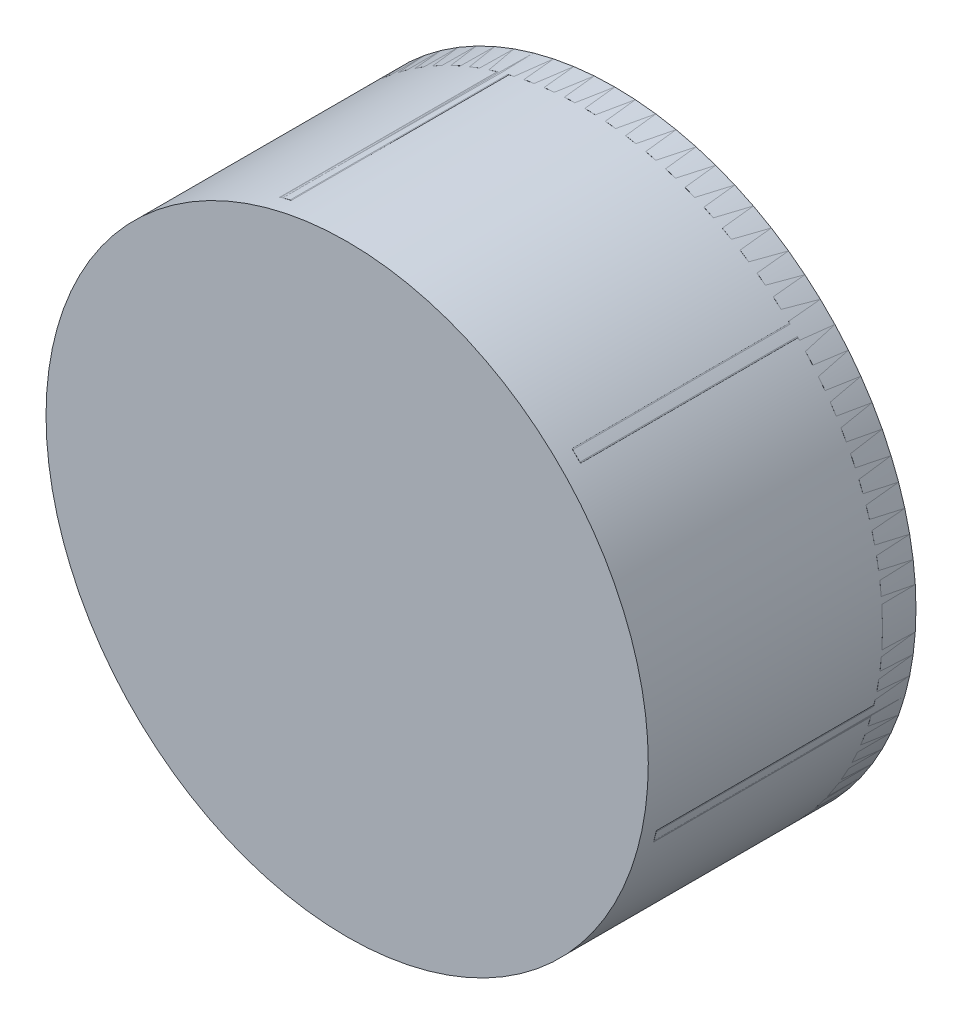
ISO-10303-21;
HEADER;
FILE_DESCRIPTION(('STEP AP214'),'2;1');
FILE_NAME('part.step','',(''),(''),'','','');
FILE_SCHEMA(('AUTOMOTIVE_DESIGN { 1 0 10303 214 1 1 1 1 }'));
ENDSEC;
DATA;
#1=APPLICATION_CONTEXT('core data for automotive mechanical design processes');
#2=APPLICATION_PROTOCOL_DEFINITION('international standard','automotive_design',2000,#1);
#3=PRODUCT_CONTEXT('',#1,'mechanical');
#4=PRODUCT('Part','Part','',(#3));
#5=PRODUCT_RELATED_PRODUCT_CATEGORY('part','',(#4));
#6=PRODUCT_DEFINITION_FORMATION('','',#4);
#7=PRODUCT_DEFINITION_CONTEXT('part definition',#1,'design');
#8=PRODUCT_DEFINITION('design','',#6,#7);
#9=PRODUCT_DEFINITION_SHAPE('','',#8);
#10=(LENGTH_UNIT() NAMED_UNIT(*) SI_UNIT(.MILLI.,.METRE.));
#11=(NAMED_UNIT(*) PLANE_ANGLE_UNIT() SI_UNIT($,.RADIAN.));
#12=(NAMED_UNIT(*) SI_UNIT($,.STERADIAN.) SOLID_ANGLE_UNIT());
#13=UNCERTAINTY_MEASURE_WITH_UNIT(LENGTH_MEASURE(1.E-05),#10,'distance_accuracy_value','');
#14=(GEOMETRIC_REPRESENTATION_CONTEXT(3) GLOBAL_UNCERTAINTY_ASSIGNED_CONTEXT((#13)) GLOBAL_UNIT_ASSIGNED_CONTEXT((#10,
#11,#12)) REPRESENTATION_CONTEXT('',''));
#15=CARTESIAN_POINT('',(0.,0.,0.));
#16=DIRECTION('',(0.,0.,1.));
#17=DIRECTION('',(1.,0.,0.));
#18=AXIS2_PLACEMENT_3D('',#15,#16,#17);
#19=CARTESIAN_POINT('',(0.,0.,14.));
#20=DIRECTION('',(0.,0.,-1.));
#21=DIRECTION('',(-1.,0.,0.));
#22=AXIS2_PLACEMENT_3D('',#19,#20,#21);
#23=CYLINDRICAL_SURFACE('',#22,18.);
#24=CARTESIAN_POINT('',(0.,0.,14.));
#25=DIRECTION('',(0.,0.,-1.));
#26=DIRECTION('',(-1.,0.,0.));
#27=AXIS2_PLACEMENT_3D('',#24,#25,#26);
#28=CIRCLE('',#27,18.);
#29=CARTESIAN_POINT('',(-18.,0.,14.));
#30=VERTEX_POINT('',#29);
#31=EDGE_CURVE('E11',#30,#30,#28,.T.);
#32=ORIENTED_EDGE('',*,*,#31,.T.);
#33=EDGE_LOOP('',(#32));
#34=FACE_BOUND('',#33,.T.);
#35=CARTESIAN_POINT('',(0.,0.,-2.));
#36=DIRECTION('',(0.,0.,-1.));
#37=DIRECTION('',(-1.,0.,0.));
#38=AXIS2_PLACEMENT_3D('',#35,#36,#37);
#39=CIRCLE('',#38,18.);
#40=CARTESIAN_POINT('',(-18.,0.,-2.));
#41=VERTEX_POINT('',#40);
#42=EDGE_CURVE('E58',#41,#41,#39,.T.);
#43=ORIENTED_EDGE('',*,*,#42,.F.);
#44=EDGE_LOOP('',(#43));
#45=FACE_BOUND('',#44,.T.);
#46=ADVANCED_FACE('F55',(#34,#45),#23,.T.);
#47=CARTESIAN_POINT('',(0.,0.,14.));
#48=DIRECTION('',(0.,0.,-1.));
#49=DIRECTION('',(-1.,0.,0.));
#50=AXIS2_PLACEMENT_3D('',#47,#48,#49);
#51=PLANE('',#50);
#52=ORIENTED_EDGE('',*,*,#31,.F.);
#53=EDGE_LOOP('',(#52));
#54=FACE_BOUND('',#53,.T.);
#55=ADVANCED_FACE('F72',(#54),#51,.F.);
#56=CARTESIAN_POINT('',(0.,0.,-2.));
#57=DIRECTION('',(0.,0.,-1.));
#58=DIRECTION('',(-1.,0.,0.));
#59=AXIS2_PLACEMENT_3D('',#56,#57,#58);
#60=PLANE('',#59);
#61=ORIENTED_EDGE('',*,*,#42,.T.);
#62=EDGE_LOOP('',(#61));
#63=FACE_BOUND('',#62,.T.);
#64=ADVANCED_FACE('F69',(#63),#60,.T.);
#65=CLOSED_SHELL('',(#46,#55,#64));
#66=MANIFOLD_SOLID_BREP('B2_NOT_SHOWN',#65);
#67=CARTESIAN_POINT('',(0.,0.,0.));
#68=DIRECTION('',(0.,0.,1.));
#69=DIRECTION('',(1.,0.,0.));
#70=AXIS2_PLACEMENT_3D('',#67,#68,#69);
#71=PLANE('',#70);
#72=CARTESIAN_POINT('',(0.,0.,0.));
#73=DIRECTION('',(0.,0.,1.));
#74=DIRECTION('',(1.,0.,0.));
#75=AXIS2_PLACEMENT_3D('',#72,#73,#74);
#76=CIRCLE('',#75,3.);
#77=CARTESIAN_POINT('',(3.,0.,0.));
#78=VERTEX_POINT('',#77);
#79=EDGE_CURVE('E462',#78,#78,#76,.F.);
#80=ORIENTED_EDGE('',*,*,#79,.T.);
#81=EDGE_LOOP('',(#80));
#82=FACE_BOUND('',#81,.T.);
#83=CARTESIAN_POINT('',(0.,0.,0.));
#84=DIRECTION('',(0.,0.,1.));
#85=DIRECTION('',(1.,0.,0.));
#86=AXIS2_PLACEMENT_3D('',#83,#84,#85);
#87=CIRCLE('',#86,18.);
#88=CARTESIAN_POINT('',(12.4831508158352,12.9680740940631,0.));
#89=VERTEX_POINT('',#88);
#90=CARTESIAN_POINT('',(-4.40338510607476,17.4530856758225,0.));
#91=VERTEX_POINT('',#90);
#92=EDGE_CURVE('E118',#89,#91,#87,.T.);
#93=ORIENTED_EDGE('',*,*,#92,.T.);
#94=CARTESIAN_POINT('',(-4.35445860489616,17.2591625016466,0.));
#95=DIRECTION('',(0.,0.,1.));
#96=DIRECTION('',(1.,0.,0.));
#97=AXIS2_PLACEMENT_3D('',#94,#95,#96);
#98=CIRCLE('',#97,0.2);
#99=CARTESIAN_POINT('',(-4.16138757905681,17.3113504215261,0.));
#100=VERTEX_POINT('',#99);
#101=EDGE_CURVE('E111',#91,#100,#98,.F.);
#102=ORIENTED_EDGE('',*,*,#101,.T.);
#103=DIRECTION('',(-0.260939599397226,0.96535512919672,0.));
#104=VECTOR('',#103,1.);
#105=CARTESIAN_POINT('',(-1.60706181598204,7.86153336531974,0.));
#106=LINE('',#105,#104);
#107=CARTESIAN_POINT('',(-1.65924973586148,8.05460439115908,0.));
#108=VERTEX_POINT('',#107);
#109=EDGE_CURVE('E671',#108,#100,#106,.T.);
#110=ORIENTED_EDGE('',*,*,#109,.F.);
#111=CARTESIAN_POINT('',(-1.85232076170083,8.00241647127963,0.));
#112=DIRECTION('',(0.,0.,1.));
#113=DIRECTION('',(1.,0.,0.));
#114=AXIS2_PLACEMENT_3D('',#111,#112,#113);
#115=CIRCLE('',#114,0.2);
#116=CARTESIAN_POINT('',(-1.80013284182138,7.80934544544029,0.));
#117=VERTEX_POINT('',#116);
#118=EDGE_CURVE('E668',#108,#117,#115,.F.);
#119=ORIENTED_EDGE('',*,*,#118,.T.);
#120=DIRECTION('',(0.96535512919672,0.260939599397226,0.));
#121=VECTOR('',#120,1.);
#122=CARTESIAN_POINT('',(-2.57241694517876,7.60059376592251,0.));
#123=LINE('',#122,#121);
#124=CARTESIAN_POINT('',(-2.37934591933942,7.65278168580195,0.));
#125=VERTEX_POINT('',#124);
#126=EDGE_CURVE('E681',#125,#117,#123,.T.);
#127=ORIENTED_EDGE('',*,*,#126,.F.);
#128=CARTESIAN_POINT('',(-2.43153383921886,7.8458527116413,0.));
#129=DIRECTION('',(0.,0.,1.));
#130=DIRECTION('',(1.,0.,0.));
#131=AXIS2_PLACEMENT_3D('',#128,#129,#130);
#132=CIRCLE('',#131,0.2);
#133=CARTESIAN_POINT('',(-2.6246048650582,7.79366479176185,0.));
#134=VERTEX_POINT('',#133);
#135=EDGE_CURVE('E666',#125,#134,#132,.F.);
#136=ORIENTED_EDGE('',*,*,#135,.T.);
#137=DIRECTION('',(0.260939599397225,-0.96535512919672,0.));
#138=VECTOR('',#137,1.);
#139=CARTESIAN_POINT('',(-2.57241694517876,7.60059376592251,0.));
#140=LINE('',#139,#138);
#141=CARTESIAN_POINT('',(-5.12674270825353,17.0504108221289,0.));
#142=VERTEX_POINT('',#141);
#143=EDGE_CURVE('E680',#142,#134,#140,.T.);
#144=ORIENTED_EDGE('',*,*,#143,.F.);
#145=CARTESIAN_POINT('',(-4.93367168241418,17.1025987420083,0.));
#146=DIRECTION('',(0.,0.,1.));
#147=DIRECTION('',(1.,0.,0.));
#148=AXIS2_PLACEMENT_3D('',#145,#146,#147);
#149=CIRCLE('',#148,0.2);
#150=CARTESIAN_POINT('',(-4.98910619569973,17.2947627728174,0.));
#151=VERTEX_POINT('',#150);
#152=EDGE_CURVE('E53',#142,#151,#149,.F.);
#153=ORIENTED_EDGE('',*,*,#152,.T.);
#154=CARTESIAN_POINT('',(-17.3165081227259,4.9130994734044,0.));
#155=VERTEX_POINT('',#154);
#156=EDGE_CURVE('E126',#151,#155,#87,.T.);
#157=ORIENTED_EDGE('',*,*,#156,.T.);
#158=CARTESIAN_POINT('',(-17.1241024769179,4.85850947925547,0.));
#159=DIRECTION('',(0.,0.,1.));
#160=DIRECTION('',(1.,0.,0.));
#161=AXIS2_PLACEMENT_3D('',#158,#159,#160);
#162=CIRCLE('',#161,0.2);
#163=CARTESIAN_POINT('',(-17.0727630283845,5.05180785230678,0.));
#164=VERTEX_POINT('',#163);
#165=EDGE_CURVE('E633',#155,#164,#162,.F.);
#166=ORIENTED_EDGE('',*,*,#165,.T.);
#167=DIRECTION('',(-0.966491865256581,0.256697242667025,0.));
#168=VECTOR('',#167,1.);
#169=CARTESIAN_POINT('',(-7.61181851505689,2.53901032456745,0.));
#170=LINE('',#169,#168);
#171=CARTESIAN_POINT('',(-7.8051168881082,2.59034977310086,0.));
#172=VERTEX_POINT('',#171);
#173=EDGE_CURVE('E723',#172,#164,#170,.T.);
#174=ORIENTED_EDGE('',*,*,#173,.F.);
#175=CARTESIAN_POINT('',(-7.85645633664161,2.39705140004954,0.));
#176=DIRECTION('',(0.,0.,1.));
#177=DIRECTION('',(1.,0.,0.));
#178=AXIS2_PLACEMENT_3D('',#175,#176,#177);
#179=CIRCLE('',#178,0.2);
#180=CARTESIAN_POINT('',(-7.66315796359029,2.34571195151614,0.));
#181=VERTEX_POINT('',#180);
#182=EDGE_CURVE('E631',#172,#181,#179,.F.);
#183=ORIENTED_EDGE('',*,*,#182,.T.);
#184=DIRECTION('',(0.256697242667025,0.966491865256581,0.));
#185=VECTOR('',#184,1.);
#186=CARTESIAN_POINT('',(-7.86851575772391,1.57251845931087,0.));
#187=LINE('',#186,#185);
#188=CARTESIAN_POINT('',(-7.81717630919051,1.76581683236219,0.));
#189=VERTEX_POINT('',#188);
#190=EDGE_CURVE('E697',#189,#181,#187,.T.);
#191=ORIENTED_EDGE('',*,*,#190,.F.);
#192=CARTESIAN_POINT('',(-8.01047468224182,1.81715628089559,0.));
#193=DIRECTION('',(0.,0.,1.));
#194=DIRECTION('',(1.,0.,0.));
#195=AXIS2_PLACEMENT_3D('',#192,#193,#194);
#196=CIRCLE('',#195,0.2);
#197=CARTESIAN_POINT('',(-8.06181413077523,1.62385790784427,0.));
#198=VERTEX_POINT('',#197);
#199=EDGE_CURVE('E629',#189,#198,#196,.F.);
#200=ORIENTED_EDGE('',*,*,#199,.T.);
#201=DIRECTION('',(0.966491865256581,-0.256697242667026,0.));
#202=VECTOR('',#201,1.);
#203=CARTESIAN_POINT('',(-7.86851575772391,1.57251845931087,0.));
#204=LINE('',#203,#202);
#205=CARTESIAN_POINT('',(-17.3294602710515,4.08531598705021,0.));
#206=VERTEX_POINT('',#205);
#207=EDGE_CURVE('E711',#206,#198,#204,.T.);
#208=ORIENTED_EDGE('',*,*,#207,.F.);
#209=CARTESIAN_POINT('',(-17.2781208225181,4.27861436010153,0.));
#210=DIRECTION('',(0.,0.,1.));
#211=DIRECTION('',(1.,0.,0.));
#212=AXIS2_PLACEMENT_3D('',#209,#210,#211);
#213=CIRCLE('',#212,0.2);
#214=CARTESIAN_POINT('',(-17.4722570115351,4.32668867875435,0.));
#215=VERTEX_POINT('',#214);
#216=EDGE_CURVE('E635',#206,#215,#213,.F.);
#217=ORIENTED_EDGE('',*,*,#216,.T.);
#218=CARTESIAN_POINT('',(-12.913123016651,-12.5399862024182,0.));
#219=VERTEX_POINT('',#218);
#220=EDGE_CURVE('E1040',#215,#219,#87,.T.);
#221=ORIENTED_EDGE('',*,*,#220,.T.);
#222=CARTESIAN_POINT('',(-12.7696438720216,-12.4006530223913,0.));
#223=DIRECTION('',(0.,0.,1.));
#224=DIRECTION('',(1.,0.,0.));
#225=AXIS2_PLACEMENT_3D('',#222,#223,#224);
#226=CIRCLE('',#225,0.2);
#227=CARTESIAN_POINT('',(-12.9113754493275,-12.2595425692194,0.));
#228=VERTEX_POINT('',#227);
#229=EDGE_CURVE('E597',#219,#228,#226,.F.);
#230=ORIENTED_EDGE('',*,*,#229,.T.);
#231=DIRECTION('',(-0.705552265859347,-0.7086578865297,0.));
#232=VECTOR('',#231,1.);
#233=CARTESIAN_POINT('',(-6.00475669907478,-5.32252304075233,0.));
#234=LINE('',#233,#232);
#235=CARTESIAN_POINT('',(-6.14586715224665,-5.46425461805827,0.));
#236=VERTEX_POINT('',#235);
#237=EDGE_CURVE('E744',#236,#228,#234,.T.);
#238=ORIENTED_EDGE('',*,*,#237,.F.);
#239=CARTESIAN_POINT('',(-6.00413557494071,-5.60536507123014,0.));
#240=DIRECTION('',(0.,0.,1.));
#241=DIRECTION('',(1.,0.,0.));
#242=AXIS2_PLACEMENT_3D('',#239,#240,#241);
#243=CIRCLE('',#242,0.2);
#244=CARTESIAN_POINT('',(-5.86302512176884,-5.4636334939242,0.));
#245=VERTEX_POINT('',#244);
#246=EDGE_CURVE('E595',#236,#245,#243,.F.);
#247=ORIENTED_EDGE('',*,*,#246,.T.);
#248=DIRECTION('',(-0.7086578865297,0.705552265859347,0.));
#249=VECTOR('',#248,1.);
#250=CARTESIAN_POINT('',(-5.29609881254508,-6.02807530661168,0.));
#251=LINE('',#250,#249);
#252=CARTESIAN_POINT('',(-5.43783038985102,-5.88696485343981,0.));
#253=VERTEX_POINT('',#252);
#254=EDGE_CURVE('E720',#253,#245,#251,.T.);
#255=ORIENTED_EDGE('',*,*,#254,.F.);
#256=CARTESIAN_POINT('',(-5.57894084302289,-6.02869643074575,0.));
#257=DIRECTION('',(0.,0.,1.));
#258=DIRECTION('',(1.,0.,0.));
#259=AXIS2_PLACEMENT_3D('',#256,#257,#258);
#260=CIRCLE('',#259,0.2);
#261=CARTESIAN_POINT('',(-5.43720926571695,-6.16980688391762,0.));
#262=VERTEX_POINT('',#261);
#263=EDGE_CURVE('E593',#253,#262,#260,.F.);
#264=ORIENTED_EDGE('',*,*,#263,.T.);
#265=DIRECTION('',(0.705552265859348,0.7086578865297,0.));
#266=VECTOR('',#265,1.);
#267=CARTESIAN_POINT('',(-5.29609881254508,-6.02807530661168,0.));
#268=LINE('',#267,#266);
#269=CARTESIAN_POINT('',(-12.2027175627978,-12.9650948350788,0.));
#270=VERTEX_POINT('',#269);
#271=EDGE_CURVE('E732',#270,#262,#268,.T.);
#272=ORIENTED_EDGE('',*,*,#271,.F.);
#273=CARTESIAN_POINT('',(-12.3444491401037,-12.8239843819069,0.));
#274=DIRECTION('',(0.,0.,1.));
#275=DIRECTION('',(1.,0.,0.));
#276=AXIS2_PLACEMENT_3D('',#273,#274,#275);
#277=CIRCLE('',#276,0.2);
#278=CARTESIAN_POINT('',(-12.4831508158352,-12.9680740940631,0.));
#279=VERTEX_POINT('',#278);
#280=EDGE_CURVE('E599',#270,#279,#277,.F.);
#281=ORIENTED_EDGE('',*,*,#280,.T.);
#282=CARTESIAN_POINT('',(4.40338510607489,-17.4530856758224,0.));
#283=VERTEX_POINT('',#282);
#284=EDGE_CURVE('E1061',#279,#283,#87,.T.);
#285=ORIENTED_EDGE('',*,*,#284,.T.);
#286=CARTESIAN_POINT('',(4.35445860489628,-17.2591625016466,0.));
#287=DIRECTION('',(0.,0.,1.));
#288=DIRECTION('',(1.,0.,0.));
#289=AXIS2_PLACEMENT_3D('',#286,#287,#288);
#290=CIRCLE('',#289,0.2);
#291=CARTESIAN_POINT('',(4.16138757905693,-17.3113504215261,0.));
#292=VERTEX_POINT('',#291);
#293=EDGE_CURVE('E560',#283,#292,#290,.F.);
#294=ORIENTED_EDGE('',*,*,#293,.T.);
#295=DIRECTION('',(0.260939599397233,-0.965355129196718,0.));
#296=VECTOR('',#295,1.);
#297=CARTESIAN_POINT('',(1.60706181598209,-7.86153336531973,0.));
#298=LINE('',#297,#296);
#299=CARTESIAN_POINT('',(1.65924973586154,-8.05460439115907,0.));
#300=VERTEX_POINT('',#299);
#301=EDGE_CURVE('E765',#300,#292,#298,.T.);
#302=ORIENTED_EDGE('',*,*,#301,.F.);
#303=CARTESIAN_POINT('',(1.85232076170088,-8.00241647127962,0.));
#304=DIRECTION('',(0.,0.,1.));
#305=DIRECTION('',(1.,0.,0.));
#306=AXIS2_PLACEMENT_3D('',#303,#304,#305);
#307=CIRCLE('',#306,0.2);
#308=CARTESIAN_POINT('',(1.80013284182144,-7.80934544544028,0.));
#309=VERTEX_POINT('',#308);
#310=EDGE_CURVE('E558',#300,#309,#307,.F.);
#311=ORIENTED_EDGE('',*,*,#310,.T.);
#312=DIRECTION('',(-0.965355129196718,-0.260939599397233,0.));
#313=VECTOR('',#312,1.);
#314=CARTESIAN_POINT('',(2.57241694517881,-7.60059376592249,0.));
#315=LINE('',#314,#313);
#316=CARTESIAN_POINT('',(2.37934591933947,-7.65278168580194,0.));
#317=VERTEX_POINT('',#316);
#318=EDGE_CURVE('E741',#317,#309,#315,.T.);
#319=ORIENTED_EDGE('',*,*,#318,.F.);
#320=CARTESIAN_POINT('',(2.43153383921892,-7.84585271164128,0.));
#321=DIRECTION('',(0.,0.,1.));
#322=DIRECTION('',(1.,0.,0.));
#323=AXIS2_PLACEMENT_3D('',#320,#321,#322);
#324=CIRCLE('',#323,0.2);
#325=CARTESIAN_POINT('',(2.62460486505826,-7.79366479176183,0.));
#326=VERTEX_POINT('',#325);
#327=EDGE_CURVE('E556',#317,#326,#324,.F.);
#328=ORIENTED_EDGE('',*,*,#327,.T.);
#329=DIRECTION('',(-0.260939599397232,0.965355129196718,0.));
#330=VECTOR('',#329,1.);
#331=CARTESIAN_POINT('',(2.57241694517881,-7.60059376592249,0.));
#332=LINE('',#331,#330);
#333=CARTESIAN_POINT('',(5.12674270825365,-17.0504108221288,0.));
#334=VERTEX_POINT('',#333);
#335=EDGE_CURVE('E753',#334,#326,#332,.T.);
#336=ORIENTED_EDGE('',*,*,#335,.F.);
#337=CARTESIAN_POINT('',(4.9336716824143,-17.1025987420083,0.));
#338=DIRECTION('',(0.,0.,1.));
#339=DIRECTION('',(1.,0.,0.));
#340=AXIS2_PLACEMENT_3D('',#337,#338,#339);
#341=CIRCLE('',#340,0.2);
#342=CARTESIAN_POINT('',(4.98910619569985,-17.2947627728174,0.));
#343=VERTEX_POINT('',#342);
#344=EDGE_CURVE('E562',#334,#343,#341,.F.);
#345=ORIENTED_EDGE('',*,*,#344,.T.);
#346=CARTESIAN_POINT('',(17.316508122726,-4.91309947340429,0.));
#347=VERTEX_POINT('',#346);
#348=EDGE_CURVE('E1082',#343,#347,#87,.T.);
#349=ORIENTED_EDGE('',*,*,#348,.T.);
#350=CARTESIAN_POINT('',(17.1241024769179,-4.85850947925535,0.));
#351=DIRECTION('',(0.,0.,1.));
#352=DIRECTION('',(1.,0.,0.));
#353=AXIS2_PLACEMENT_3D('',#350,#351,#352);
#354=CIRCLE('',#353,0.2);
#355=CARTESIAN_POINT('',(17.0727630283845,-5.05180785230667,0.));
#356=VERTEX_POINT('',#355);
#357=EDGE_CURVE('E523',#347,#356,#354,.F.);
#358=ORIENTED_EDGE('',*,*,#357,.T.);
#359=DIRECTION('',(0.966491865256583,-0.256697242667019,0.));
#360=VECTOR('',#359,1.);
#361=CARTESIAN_POINT('',(7.6118185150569,-2.5390103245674,0.));
#362=LINE('',#361,#360);
#363=CARTESIAN_POINT('',(7.80511688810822,-2.5903497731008,0.));
#364=VERTEX_POINT('',#363);
#365=EDGE_CURVE('E781',#364,#356,#362,.T.);
#366=ORIENTED_EDGE('',*,*,#365,.F.);
#367=CARTESIAN_POINT('',(7.85645633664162,-2.39705140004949,0.));
#368=DIRECTION('',(0.,0.,1.));
#369=DIRECTION('',(1.,0.,0.));
#370=AXIS2_PLACEMENT_3D('',#367,#368,#369);
#371=CIRCLE('',#370,0.2);
#372=CARTESIAN_POINT('',(7.66315796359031,-2.34571195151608,0.));
#373=VERTEX_POINT('',#372);
#374=EDGE_CURVE('E521',#364,#373,#371,.F.);
#375=ORIENTED_EDGE('',*,*,#374,.T.);
#376=DIRECTION('',(-0.256697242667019,-0.966491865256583,0.));
#377=VECTOR('',#376,1.);
#378=CARTESIAN_POINT('',(7.86851575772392,-1.57251845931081,0.));
#379=LINE('',#378,#377);
#380=CARTESIAN_POINT('',(7.81717630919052,-1.76581683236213,0.));
#381=VERTEX_POINT('',#380);
#382=EDGE_CURVE('E762',#381,#373,#379,.T.);
#383=ORIENTED_EDGE('',*,*,#382,.F.);
#384=CARTESIAN_POINT('',(8.01047468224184,-1.81715628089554,0.));
#385=DIRECTION('',(0.,0.,1.));
#386=DIRECTION('',(1.,0.,0.));
#387=AXIS2_PLACEMENT_3D('',#384,#385,#386);
#388=CIRCLE('',#387,0.2);
#389=CARTESIAN_POINT('',(8.06181413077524,-1.62385790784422,0.));
#390=VERTEX_POINT('',#389);
#391=EDGE_CURVE('E519',#381,#390,#388,.F.);
#392=ORIENTED_EDGE('',*,*,#391,.T.);
#393=DIRECTION('',(-0.966491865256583,0.25669724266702,0.));
#394=VECTOR('',#393,1.);
#395=CARTESIAN_POINT('',(7.86851575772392,-1.57251845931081,0.));
#396=LINE('',#395,#394);
#397=CARTESIAN_POINT('',(17.3294602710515,-4.08531598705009,0.));
#398=VERTEX_POINT('',#397);
#399=EDGE_CURVE('E774',#398,#390,#396,.T.);
#400=ORIENTED_EDGE('',*,*,#399,.F.);
#401=CARTESIAN_POINT('',(17.2781208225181,-4.27861436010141,0.));
#402=DIRECTION('',(0.,0.,1.));
#403=DIRECTION('',(1.,0.,0.));
#404=AXIS2_PLACEMENT_3D('',#401,#402,#403);
#405=CIRCLE('',#404,0.2);
#406=CARTESIAN_POINT('',(17.4722570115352,-4.32668867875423,0.));
#407=VERTEX_POINT('',#406);
#408=EDGE_CURVE('E525',#398,#407,#405,.F.);
#409=ORIENTED_EDGE('',*,*,#408,.T.);
#410=CARTESIAN_POINT('',(12.913123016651,12.5399862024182,0.));
#411=VERTEX_POINT('',#410);
#412=EDGE_CURVE('E451',#407,#411,#87,.T.);
#413=ORIENTED_EDGE('',*,*,#412,.T.);
#414=CARTESIAN_POINT('',(12.7696438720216,12.4006530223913,0.));
#415=DIRECTION('',(0.,0.,1.));
#416=DIRECTION('',(1.,0.,0.));
#417=AXIS2_PLACEMENT_3D('',#414,#415,#416);
#418=CIRCLE('',#417,0.2);
#419=CARTESIAN_POINT('',(12.9113754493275,12.2595425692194,0.));
#420=VERTEX_POINT('',#419);
#421=EDGE_CURVE('E487',#411,#420,#418,.F.);
#422=ORIENTED_EDGE('',*,*,#421,.T.);
#423=DIRECTION('',(0.705552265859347,0.7086578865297,0.));
#424=VECTOR('',#423,1.);
#425=CARTESIAN_POINT('',(6.00475669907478,5.32252304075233,0.));
#426=LINE('',#425,#424);
#427=CARTESIAN_POINT('',(6.14586715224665,5.46425461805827,0.));
#428=VERTEX_POINT('',#427);
#429=EDGE_CURVE('E431',#428,#420,#426,.T.);
#430=ORIENTED_EDGE('',*,*,#429,.F.);
#431=CARTESIAN_POINT('',(6.00413557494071,5.60536507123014,0.));
#432=DIRECTION('',(0.,0.,1.));
#433=DIRECTION('',(1.,0.,0.));
#434=AXIS2_PLACEMENT_3D('',#431,#432,#433);
#435=CIRCLE('',#434,0.2);
#436=CARTESIAN_POINT('',(5.86302512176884,5.4636334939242,0.));
#437=VERTEX_POINT('',#436);
#438=EDGE_CURVE('E416',#428,#437,#435,.F.);
#439=ORIENTED_EDGE('',*,*,#438,.T.);
#440=DIRECTION('',(0.7086578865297,-0.705552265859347,0.));
#441=VECTOR('',#440,1.);
#442=CARTESIAN_POINT('',(5.29609881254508,6.02807530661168,0.));
#443=LINE('',#442,#441);
#444=CARTESIAN_POINT('',(5.43783038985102,5.88696485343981,0.));
#445=VERTEX_POINT('',#444);
#446=EDGE_CURVE('E423',#445,#437,#443,.T.);
#447=ORIENTED_EDGE('',*,*,#446,.F.);
#448=CARTESIAN_POINT('',(5.57894084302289,6.02869643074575,0.));
#449=DIRECTION('',(0.,0.,1.));
#450=DIRECTION('',(1.,0.,0.));
#451=AXIS2_PLACEMENT_3D('',#448,#449,#450);
#452=CIRCLE('',#451,0.2);
#453=CARTESIAN_POINT('',(5.43720926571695,6.16980688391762,0.));
#454=VERTEX_POINT('',#453);
#455=EDGE_CURVE('E407',#445,#454,#452,.F.);
#456=ORIENTED_EDGE('',*,*,#455,.T.);
#457=DIRECTION('',(-0.705552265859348,-0.7086578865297,0.));
#458=VECTOR('',#457,1.);
#459=CARTESIAN_POINT('',(5.29609881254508,6.02807530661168,0.));
#460=LINE('',#459,#458);
#461=CARTESIAN_POINT('',(12.2027175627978,12.9650948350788,0.));
#462=VERTEX_POINT('',#461);
#463=EDGE_CURVE('E435',#462,#454,#460,.T.);
#464=ORIENTED_EDGE('',*,*,#463,.F.);
#465=CARTESIAN_POINT('',(12.3444491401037,12.8239843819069,0.));
#466=DIRECTION('',(0.,0.,1.));
#467=DIRECTION('',(1.,0.,0.));
#468=AXIS2_PLACEMENT_3D('',#465,#466,#467);
#469=CIRCLE('',#468,0.2);
#470=EDGE_CURVE('E489',#462,#89,#469,.F.);
#471=ORIENTED_EDGE('',*,*,#470,.T.);
#472=EDGE_LOOP('',(#93,#102,#110,#119,#127,#136,#144,#153,#157,#166,#174,#183,#191,#200,#208,
#217,#221,#230,#238,#247,#255,#264,#272,#281,#285,#294,#302,#311,#319,#328,#336,#345,#349,#358,
#366,#375,#383,#392,#400,#409,#413,#422,#430,#439,#447,#456,#464,#471));
#473=FACE_BOUND('',#472,.T.);
#474=ADVANCED_FACE('F103',(#82,#473),#71,.T.);
#475=CARTESIAN_POINT('',(0.,0.,-2.));
#476=DIRECTION('',(0.,0.,1.));
#477=DIRECTION('',(1.,0.,0.));
#478=AXIS2_PLACEMENT_3D('',#475,#476,#477);
#479=CYLINDRICAL_SURFACE('',#478,18.);
#480=CARTESIAN_POINT('',(0.,0.,-2.));
#481=DIRECTION('',(0.,0.,1.));
#482=DIRECTION('',(1.,0.,0.));
#483=AXIS2_PLACEMENT_3D('',#480,#481,#482);
#484=CIRCLE('',#483,18.);
#485=CARTESIAN_POINT('',(18.,0.,-2.));
#486=VERTEX_POINT('',#485);
#487=EDGE_CURVE('E452',#486,#486,#484,.T.);
#488=ORIENTED_EDGE('',*,*,#487,.T.);
#489=EDGE_LOOP('',(#488));
#490=FACE_BOUND('',#489,.T.);
#491=CARTESIAN_POINT('',(0.,0.,13.));
#492=DIRECTION('',(0.,0.,1.));
#493=DIRECTION('',(0.50000000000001,0.866025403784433,0.));
#494=AXIS2_PLACEMENT_3D('',#491,#492,#493);
#495=CIRCLE('',#494,18.);
#496=CARTESIAN_POINT('',(-4.40338510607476,17.4530856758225,13.));
#497=VERTEX_POINT('',#496);
#498=CARTESIAN_POINT('',(-4.98910619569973,17.2947627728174,13.));
#499=VERTEX_POINT('',#498);
#500=EDGE_CURVE('E690',#497,#499,#495,.T.);
#501=ORIENTED_EDGE('',*,*,#500,.F.);
#502=DIRECTION('',(0.,0.,1.));
#503=VECTOR('',#502,1.);
#504=CARTESIAN_POINT('',(-4.40338510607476,17.4530856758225,-2.));
#505=LINE('',#504,#503);
#506=EDGE_CURVE('E663',#497,#91,#505,.F.);
#507=ORIENTED_EDGE('',*,*,#506,.T.);
#508=ORIENTED_EDGE('',*,*,#92,.F.);
#509=DIRECTION('',(0.,0.,1.));
#510=VECTOR('',#509,1.);
#511=CARTESIAN_POINT('',(12.4831508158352,12.9680740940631,-2.));
#512=LINE('',#511,#510);
#513=CARTESIAN_POINT('',(12.4831508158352,12.9680740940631,13.));
#514=VERTEX_POINT('',#513);
#515=EDGE_CURVE('E482',#89,#514,#512,.T.);
#516=ORIENTED_EDGE('',*,*,#515,.T.);
#517=CARTESIAN_POINT('',(0.,0.,13.));
#518=DIRECTION('',(0.,0.,1.));
#519=DIRECTION('',(1.,0.,0.));
#520=AXIS2_PLACEMENT_3D('',#517,#518,#519);
#521=CIRCLE('',#520,18.);
#522=CARTESIAN_POINT('',(12.913123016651,12.5399862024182,13.));
#523=VERTEX_POINT('',#522);
#524=EDGE_CURVE('E789',#523,#514,#521,.T.);
#525=ORIENTED_EDGE('',*,*,#524,.F.);
#526=DIRECTION('',(0.,0.,1.));
#527=VECTOR('',#526,1.);
#528=CARTESIAN_POINT('',(12.913123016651,12.5399862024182,-2.));
#529=LINE('',#528,#527);
#530=EDGE_CURVE('E417',#523,#411,#529,.F.);
#531=ORIENTED_EDGE('',*,*,#530,.T.);
#532=ORIENTED_EDGE('',*,*,#412,.F.);
#533=DIRECTION('',(0.,0.,1.));
#534=VECTOR('',#533,1.);
#535=CARTESIAN_POINT('',(17.4722570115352,-4.32668867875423,-2.));
#536=LINE('',#535,#534);
#537=CARTESIAN_POINT('',(17.4722570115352,-4.32668867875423,13.));
#538=VERTEX_POINT('',#537);
#539=EDGE_CURVE('E514',#407,#538,#536,.T.);
#540=ORIENTED_EDGE('',*,*,#539,.T.);
#541=CARTESIAN_POINT('',(0.,0.,13.));
#542=DIRECTION('',(0.,0.,1.));
#543=DIRECTION('',(0.499999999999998,-0.86602540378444,0.));
#544=AXIS2_PLACEMENT_3D('',#541,#542,#543);
#545=CIRCLE('',#544,18.);
#546=CARTESIAN_POINT('',(17.316508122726,-4.91309947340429,13.));
#547=VERTEX_POINT('',#546);
#548=EDGE_CURVE('E438',#547,#538,#545,.T.);
#549=ORIENTED_EDGE('',*,*,#548,.F.);
#550=DIRECTION('',(0.,0.,1.));
#551=VECTOR('',#550,1.);
#552=CARTESIAN_POINT('',(17.316508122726,-4.91309947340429,-2.));
#553=LINE('',#552,#551);
#554=EDGE_CURVE('E516',#547,#347,#553,.F.);
#555=ORIENTED_EDGE('',*,*,#554,.T.);
#556=ORIENTED_EDGE('',*,*,#348,.F.);
#557=DIRECTION('',(0.,0.,1.));
#558=VECTOR('',#557,1.);
#559=CARTESIAN_POINT('',(4.98910619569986,-17.2947627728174,-2.));
#560=LINE('',#559,#558);
#561=CARTESIAN_POINT('',(4.98910619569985,-17.2947627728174,13.));
#562=VERTEX_POINT('',#561);
#563=EDGE_CURVE('E551',#343,#562,#560,.T.);
#564=ORIENTED_EDGE('',*,*,#563,.T.);
#565=CARTESIAN_POINT('',(0.,0.,13.));
#566=DIRECTION('',(0.,0.,1.));
#567=DIRECTION('',(-0.500000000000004,-0.866025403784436,0.));
#568=AXIS2_PLACEMENT_3D('',#565,#566,#567);
#569=CIRCLE('',#568,18.);
#570=CARTESIAN_POINT('',(4.40338510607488,-17.4530856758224,13.));
#571=VERTEX_POINT('',#570);
#572=EDGE_CURVE('E756',#571,#562,#569,.T.);
#573=ORIENTED_EDGE('',*,*,#572,.F.);
#574=DIRECTION('',(0.,0.,1.));
#575=VECTOR('',#574,1.);
#576=CARTESIAN_POINT('',(4.40338510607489,-17.4530856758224,-2.));
#577=LINE('',#576,#575);
#578=EDGE_CURVE('E553',#571,#283,#577,.F.);
#579=ORIENTED_EDGE('',*,*,#578,.T.);
#580=ORIENTED_EDGE('',*,*,#284,.F.);
#581=DIRECTION('',(0.,0.,1.));
#582=VECTOR('',#581,1.);
#583=CARTESIAN_POINT('',(-12.4831508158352,-12.9680740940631,-2.));
#584=LINE('',#583,#582);
#585=CARTESIAN_POINT('',(-12.4831508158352,-12.9680740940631,13.));
#586=VERTEX_POINT('',#585);
#587=EDGE_CURVE('E588',#279,#586,#584,.T.);
#588=ORIENTED_EDGE('',*,*,#587,.T.);
#589=CARTESIAN_POINT('',(0.,0.,13.));
#590=DIRECTION('',(0.,0.,1.));
#591=DIRECTION('',(-1.,0.,0.));
#592=AXIS2_PLACEMENT_3D('',#589,#590,#591);
#593=CIRCLE('',#592,18.);
#594=CARTESIAN_POINT('',(-12.913123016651,-12.5399862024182,13.));
#595=VERTEX_POINT('',#594);
#596=EDGE_CURVE('E735',#595,#586,#593,.T.);
#597=ORIENTED_EDGE('',*,*,#596,.F.);
#598=DIRECTION('',(0.,0.,1.));
#599=VECTOR('',#598,1.);
#600=CARTESIAN_POINT('',(-12.913123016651,-12.5399862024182,-2.));
#601=LINE('',#600,#599);
#602=EDGE_CURVE('E590',#595,#219,#601,.F.);
#603=ORIENTED_EDGE('',*,*,#602,.T.);
#604=ORIENTED_EDGE('',*,*,#220,.F.);
#605=DIRECTION('',(0.,0.,1.));
#606=VECTOR('',#605,1.);
#607=CARTESIAN_POINT('',(-17.4722570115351,4.32668867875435,-2.));
#608=LINE('',#607,#606);
#609=CARTESIAN_POINT('',(-17.4722570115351,4.32668867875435,13.));
#610=VERTEX_POINT('',#609);
#611=EDGE_CURVE('E625',#215,#610,#608,.T.);
#612=ORIENTED_EDGE('',*,*,#611,.T.);
#613=CARTESIAN_POINT('',(0.,0.,13.));
#614=DIRECTION('',(0.,0.,1.));
#615=DIRECTION('',(-0.499999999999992,0.866025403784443,0.));
#616=AXIS2_PLACEMENT_3D('',#613,#614,#615);
#617=CIRCLE('',#616,18.);
#618=CARTESIAN_POINT('',(-17.3165081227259,4.9130994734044,13.));
#619=VERTEX_POINT('',#618);
#620=EDGE_CURVE('E714',#619,#610,#617,.T.);
#621=ORIENTED_EDGE('',*,*,#620,.F.);
#622=DIRECTION('',(0.,0.,1.));
#623=VECTOR('',#622,1.);
#624=CARTESIAN_POINT('',(-17.3165081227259,4.9130994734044,-2.));
#625=LINE('',#624,#623);
#626=EDGE_CURVE('E627',#619,#155,#625,.F.);
#627=ORIENTED_EDGE('',*,*,#626,.T.);
#628=ORIENTED_EDGE('',*,*,#156,.F.);
#629=DIRECTION('',(0.,0.,1.));
#630=VECTOR('',#629,1.);
#631=CARTESIAN_POINT('',(-4.98910619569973,17.2947627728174,-2.));
#632=LINE('',#631,#630);
#633=EDGE_CURVE('E661',#151,#499,#632,.T.);
#634=ORIENTED_EDGE('',*,*,#633,.T.);
#635=EDGE_LOOP('',(#501,#507,#508,#516,#525,#531,#532,#540,#549,#555,#556,#564,#573,#579,#580,
#588,#597,#603,#604,#612,#621,#627,#628,#634));
#636=FACE_BOUND('',#635,.T.);
#637=ADVANCED_FACE('F693',(#490,#636),#479,.T.);
#638=CARTESIAN_POINT('',(0.,0.,-2.));
#639=DIRECTION('',(0.,0.,1.));
#640=DIRECTION('',(1.,0.,0.));
#641=AXIS2_PLACEMENT_3D('',#638,#639,#640);
#642=PLANE('',#641);
#643=CARTESIAN_POINT('',(0.,0.,-2.));
#644=DIRECTION('',(0.,0.,1.));
#645=DIRECTION('',(1.,0.,0.));
#646=AXIS2_PLACEMENT_3D('',#643,#644,#645);
#647=CIRCLE('',#646,1.);
#648=CARTESIAN_POINT('',(1.,0.,-2.));
#649=VERTEX_POINT('',#648);
#650=EDGE_CURVE('E448',#649,#649,#647,.T.);
#651=ORIENTED_EDGE('',*,*,#650,.T.);
#652=EDGE_LOOP('',(#651));
#653=FACE_BOUND('',#652,.T.);
#654=ORIENTED_EDGE('',*,*,#487,.F.);
#655=EDGE_LOOP('',(#654));
#656=FACE_BOUND('',#655,.T.);
#657=ADVANCED_FACE('F830',(#653,#656),#642,.F.);
#658=CARTESIAN_POINT('',(0.,0.,-2.));
#659=DIRECTION('',(0.,0.,1.));
#660=DIRECTION('',(1.,0.,0.));
#661=AXIS2_PLACEMENT_3D('',#658,#659,#660);
#662=CYLINDRICAL_SURFACE('',#661,1.);
#663=ORIENTED_EDGE('',*,*,#650,.F.);
#664=EDGE_LOOP('',(#663));
#665=FACE_BOUND('',#664,.T.);
#666=CARTESIAN_POINT('',(0.,0.,6.));
#667=DIRECTION('',(0.,0.,1.));
#668=DIRECTION('',(1.,0.,0.));
#669=AXIS2_PLACEMENT_3D('',#666,#667,#668);
#670=CIRCLE('',#669,1.);
#671=CARTESIAN_POINT('',(1.,0.,6.));
#672=VERTEX_POINT('',#671);
#673=EDGE_CURVE('E445',#672,#672,#670,.T.);
#674=ORIENTED_EDGE('',*,*,#673,.T.);
#675=EDGE_LOOP('',(#674));
#676=FACE_BOUND('',#675,.T.);
#677=ADVANCED_FACE('F853',(#665,#676),#662,.F.);
#678=CARTESIAN_POINT('',(0.,0.,6.));
#679=DIRECTION('',(0.,0.,-1.));
#680=DIRECTION('',(-1.,0.,0.));
#681=AXIS2_PLACEMENT_3D('',#678,#679,#680);
#682=CYLINDRICAL_SURFACE('',#681,2.);
#683=CARTESIAN_POINT('',(0.,0.,5.));
#684=DIRECTION('',(0.,0.,1.));
#685=DIRECTION('',(1.,0.,0.));
#686=AXIS2_PLACEMENT_3D('',#683,#684,#685);
#687=CIRCLE('',#686,2.);
#688=CARTESIAN_POINT('',(2.,0.,5.));
#689=VERTEX_POINT('',#688);
#690=EDGE_CURVE('E459',#689,#689,#687,.F.);
#691=ORIENTED_EDGE('',*,*,#690,.T.);
#692=EDGE_LOOP('',(#691));
#693=FACE_BOUND('',#692,.T.);
#694=CARTESIAN_POINT('',(0.,0.,1.));
#695=DIRECTION('',(0.,0.,1.));
#696=DIRECTION('',(1.,0.,0.));
#697=AXIS2_PLACEMENT_3D('',#694,#695,#696);
#698=CIRCLE('',#697,2.);
#699=CARTESIAN_POINT('',(2.,0.,1.));
#700=VERTEX_POINT('',#699);
#701=EDGE_CURVE('E455',#700,#700,#698,.T.);
#702=ORIENTED_EDGE('',*,*,#701,.T.);
#703=EDGE_LOOP('',(#702));
#704=FACE_BOUND('',#703,.T.);
#705=ADVANCED_FACE('F840',(#693,#704),#682,.T.);
#706=CARTESIAN_POINT('',(0.,0.,5.));
#707=DIRECTION('',(0.,0.,1.));
#708=DIRECTION('',(1.,0.,0.));
#709=AXIS2_PLACEMENT_3D('',#706,#707,#708);
#710=DEGENERATE_TOROIDAL_SURFACE('',#709,1.,1.,.T.);
#711=ORIENTED_EDGE('',*,*,#690,.F.);
#712=EDGE_LOOP('',(#711));
#713=FACE_BOUND('',#712,.T.);
#714=ORIENTED_EDGE('',*,*,#673,.F.);
#715=EDGE_LOOP('',(#714));
#716=FACE_BOUND('',#715,.T.);
#717=ADVANCED_FACE('F836',(#713,#716),#710,.T.);
#718=CARTESIAN_POINT('',(0.,0.,1.));
#719=DIRECTION('',(0.,0.,1.));
#720=DIRECTION('',(1.,0.,0.));
#721=AXIS2_PLACEMENT_3D('',#718,#719,#720);
#722=TOROIDAL_SURFACE('',#721,3.,1.);
#723=ORIENTED_EDGE('',*,*,#79,.F.);
#724=EDGE_LOOP('',(#723));
#725=FACE_BOUND('',#724,.T.);
#726=ORIENTED_EDGE('',*,*,#701,.F.);
#727=EDGE_LOOP('',(#726));
#728=FACE_BOUND('',#727,.T.);
#729=ADVANCED_FACE('F839',(#725,#728),#722,.F.);
#730=CARTESIAN_POINT('',(5.29609881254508,6.02807530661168,13.));
#731=DIRECTION('',(0.705552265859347,0.7086578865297,0.));
#732=DIRECTION('',(-0.7086578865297,0.705552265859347,0.));
#733=AXIS2_PLACEMENT_3D('',#730,#731,#732);
#734=PLANE('',#733);
#735=DIRECTION('',(0.7086578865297,-0.705552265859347,0.));
#736=VECTOR('',#735,1.);
#737=CARTESIAN_POINT('',(5.29609881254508,6.02807530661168,13.));
#738=LINE('',#737,#736);
#739=CARTESIAN_POINT('',(5.43783038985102,5.88696485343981,13.));
#740=VERTEX_POINT('',#739);
#741=CARTESIAN_POINT('',(5.86302512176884,5.4636334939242,13.));
#742=VERTEX_POINT('',#741);
#743=EDGE_CURVE('E426',#740,#742,#738,.T.);
#744=ORIENTED_EDGE('',*,*,#743,.F.);
#745=DIRECTION('',(0.,0.,-1.));
#746=VECTOR('',#745,1.);
#747=CARTESIAN_POINT('',(5.43783038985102,5.88696485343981,13.));
#748=LINE('',#747,#746);
#749=EDGE_CURVE('E411',#740,#445,#748,.T.);
#750=ORIENTED_EDGE('',*,*,#749,.T.);
#751=ORIENTED_EDGE('',*,*,#446,.T.);
#752=DIRECTION('',(0.,0.,-1.));
#753=VECTOR('',#752,1.);
#754=CARTESIAN_POINT('',(5.86302512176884,5.4636334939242,13.));
#755=LINE('',#754,#753);
#756=EDGE_CURVE('E428',#437,#742,#755,.F.);
#757=ORIENTED_EDGE('',*,*,#756,.T.);
#758=EDGE_LOOP('',(#744,#750,#751,#757));
#759=FACE_BOUND('',#758,.T.);
#760=ADVANCED_FACE('F422',(#759),#734,.F.);
#761=CARTESIAN_POINT('',(6.00475669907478,5.32252304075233,13.));
#762=DIRECTION('',(-0.7086578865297,0.705552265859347,0.));
#763=DIRECTION('',(-0.705552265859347,-0.7086578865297,0.));
#764=AXIS2_PLACEMENT_3D('',#761,#762,#763);
#765=PLANE('',#764);
#766=DIRECTION('',(0.705552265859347,0.7086578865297,0.));
#767=VECTOR('',#766,1.);
#768=CARTESIAN_POINT('',(6.00475669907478,5.32252304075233,13.));
#769=LINE('',#768,#767);
#770=CARTESIAN_POINT('',(6.14586715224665,5.46425461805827,13.));
#771=VERTEX_POINT('',#770);
#772=CARTESIAN_POINT('',(12.9113754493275,12.2595425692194,13.));
#773=VERTEX_POINT('',#772);
#774=EDGE_CURVE('E787',#771,#773,#769,.T.);
#775=ORIENTED_EDGE('',*,*,#774,.F.);
#776=DIRECTION('',(0.,0.,-1.));
#777=VECTOR('',#776,1.);
#778=CARTESIAN_POINT('',(6.14586715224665,5.46425461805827,13.));
#779=LINE('',#778,#777);
#780=EDGE_CURVE('E479',#771,#428,#779,.T.);
#781=ORIENTED_EDGE('',*,*,#780,.T.);
#782=ORIENTED_EDGE('',*,*,#429,.T.);
#783=DIRECTION('',(0.,0.,-1.));
#784=VECTOR('',#783,1.);
#785=CARTESIAN_POINT('',(12.9113754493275,12.2595425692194,13.));
#786=LINE('',#785,#784);
#787=EDGE_CURVE('E477',#420,#773,#786,.F.);
#788=ORIENTED_EDGE('',*,*,#787,.T.);
#789=EDGE_LOOP('',(#775,#781,#782,#788));
#790=FACE_BOUND('',#789,.T.);
#791=ADVANCED_FACE('F811',(#790),#765,.F.);
#792=CARTESIAN_POINT('',(5.29609881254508,6.02807530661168,13.));
#793=DIRECTION('',(0.7086578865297,-0.705552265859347,0.));
#794=DIRECTION('',(0.705552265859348,0.7086578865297,0.));
#795=AXIS2_PLACEMENT_3D('',#792,#793,#794);
#796=PLANE('',#795);
#797=ORIENTED_EDGE('',*,*,#463,.T.);
#798=DIRECTION('',(0.,0.,-1.));
#799=VECTOR('',#798,1.);
#800=CARTESIAN_POINT('',(5.43720926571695,6.16980688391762,13.));
#801=LINE('',#800,#799);
#802=CARTESIAN_POINT('',(5.43720926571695,6.16980688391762,13.));
#803=VERTEX_POINT('',#802);
#804=EDGE_CURVE('E412',#454,#803,#801,.F.);
#805=ORIENTED_EDGE('',*,*,#804,.T.);
#806=DIRECTION('',(-0.705552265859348,-0.7086578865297,0.));
#807=VECTOR('',#806,1.);
#808=CARTESIAN_POINT('',(5.29609881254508,6.02807530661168,13.));
#809=LINE('',#808,#807);
#810=CARTESIAN_POINT('',(12.2027175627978,12.9650948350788,13.));
#811=VERTEX_POINT('',#810);
#812=EDGE_CURVE('E441',#811,#803,#809,.T.);
#813=ORIENTED_EDGE('',*,*,#812,.F.);
#814=DIRECTION('',(0.,0.,-1.));
#815=VECTOR('',#814,1.);
#816=CARTESIAN_POINT('',(12.2027175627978,12.9650948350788,0.));
#817=LINE('',#816,#815);
#818=EDGE_CURVE('E427',#811,#462,#817,.T.);
#819=ORIENTED_EDGE('',*,*,#818,.T.);
#820=EDGE_LOOP('',(#797,#805,#813,#819));
#821=FACE_BOUND('',#820,.T.);
#822=ADVANCED_FACE('F799',(#821),#796,.F.);
#823=CARTESIAN_POINT('',(0.,0.,13.));
#824=DIRECTION('',(0.,0.,1.));
#825=DIRECTION('',(1.,0.,0.));
#826=AXIS2_PLACEMENT_3D('',#823,#824,#825);
#827=PLANE('',#826);
#828=ORIENTED_EDGE('',*,*,#812,.T.);
#829=CARTESIAN_POINT('',(5.57894084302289,6.02869643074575,13.));
#830=DIRECTION('',(0.,0.,1.));
#831=DIRECTION('',(1.,0.,0.));
#832=AXIS2_PLACEMENT_3D('',#829,#830,#831);
#833=CIRCLE('',#832,0.2);
#834=EDGE_CURVE('E475',#803,#740,#833,.T.);
#835=ORIENTED_EDGE('',*,*,#834,.T.);
#836=ORIENTED_EDGE('',*,*,#743,.T.);
#837=CARTESIAN_POINT('',(6.00413557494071,5.60536507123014,13.));
#838=DIRECTION('',(0.,0.,1.));
#839=DIRECTION('',(1.,0.,0.));
#840=AXIS2_PLACEMENT_3D('',#837,#838,#839);
#841=CIRCLE('',#840,0.2);
#842=EDGE_CURVE('E473',#742,#771,#841,.T.);
#843=ORIENTED_EDGE('',*,*,#842,.T.);
#844=ORIENTED_EDGE('',*,*,#774,.T.);
#845=CARTESIAN_POINT('',(12.7696438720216,12.4006530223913,13.));
#846=DIRECTION('',(0.,0.,1.));
#847=DIRECTION('',(1.,0.,0.));
#848=AXIS2_PLACEMENT_3D('',#845,#846,#847);
#849=CIRCLE('',#848,0.2);
#850=EDGE_CURVE('E471',#773,#523,#849,.T.);
#851=ORIENTED_EDGE('',*,*,#850,.T.);
#852=ORIENTED_EDGE('',*,*,#524,.T.);
#853=CARTESIAN_POINT('',(12.3444491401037,12.8239843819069,13.));
#854=DIRECTION('',(0.,0.,1.));
#855=DIRECTION('',(1.,0.,0.));
#856=AXIS2_PLACEMENT_3D('',#853,#854,#855);
#857=CIRCLE('',#856,0.2);
#858=EDGE_CURVE('E469',#514,#811,#857,.T.);
#859=ORIENTED_EDGE('',*,*,#858,.T.);
#860=EDGE_LOOP('',(#828,#835,#836,#843,#844,#851,#852,#859));
#861=FACE_BOUND('',#860,.T.);
#862=ADVANCED_FACE('F796',(#861),#827,.T.);
#863=CARTESIAN_POINT('',(5.57894084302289,6.02869643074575,13.));
#864=DIRECTION('',(0.,0.,-1.));
#865=DIRECTION('',(-1.,0.,0.));
#866=AXIS2_PLACEMENT_3D('',#863,#864,#865);
#867=CYLINDRICAL_SURFACE('',#866,0.2);
#868=ORIENTED_EDGE('',*,*,#834,.F.);
#869=ORIENTED_EDGE('',*,*,#804,.F.);
#870=ORIENTED_EDGE('',*,*,#455,.F.);
#871=ORIENTED_EDGE('',*,*,#749,.F.);
#872=EDGE_LOOP('',(#868,#869,#870,#871));
#873=FACE_BOUND('',#872,.T.);
#874=ADVANCED_FACE('F410',(#873),#867,.T.);
#875=CARTESIAN_POINT('',(6.00413557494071,5.60536507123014,13.));
#876=DIRECTION('',(0.,0.,-1.));
#877=DIRECTION('',(-1.,0.,0.));
#878=AXIS2_PLACEMENT_3D('',#875,#876,#877);
#879=CYLINDRICAL_SURFACE('',#878,0.2);
#880=ORIENTED_EDGE('',*,*,#842,.F.);
#881=ORIENTED_EDGE('',*,*,#756,.F.);
#882=ORIENTED_EDGE('',*,*,#438,.F.);
#883=ORIENTED_EDGE('',*,*,#780,.F.);
#884=EDGE_LOOP('',(#880,#881,#882,#883));
#885=FACE_BOUND('',#884,.T.);
#886=ADVANCED_FACE('F815',(#885),#879,.T.);
#887=CARTESIAN_POINT('',(12.7696438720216,12.4006530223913,-2.));
#888=DIRECTION('',(0.,0.,1.));
#889=DIRECTION('',(1.,0.,0.));
#890=AXIS2_PLACEMENT_3D('',#887,#888,#889);
#891=CYLINDRICAL_SURFACE('',#890,0.2);
#892=ORIENTED_EDGE('',*,*,#850,.F.);
#893=ORIENTED_EDGE('',*,*,#787,.F.);
#894=ORIENTED_EDGE('',*,*,#421,.F.);
#895=ORIENTED_EDGE('',*,*,#530,.F.);
#896=EDGE_LOOP('',(#892,#893,#894,#895));
#897=FACE_BOUND('',#896,.T.);
#898=ADVANCED_FACE('F807',(#897),#891,.T.);
#899=CARTESIAN_POINT('',(12.3444491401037,12.8239843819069,-2.));
#900=DIRECTION('',(0.,0.,1.));
#901=DIRECTION('',(1.,0.,0.));
#902=AXIS2_PLACEMENT_3D('',#899,#900,#901);
#903=CYLINDRICAL_SURFACE('',#902,0.2);
#904=ORIENTED_EDGE('',*,*,#858,.F.);
#905=ORIENTED_EDGE('',*,*,#515,.F.);
#906=ORIENTED_EDGE('',*,*,#470,.F.);
#907=ORIENTED_EDGE('',*,*,#818,.F.);
#908=EDGE_LOOP('',(#904,#905,#906,#907));
#909=FACE_BOUND('',#908,.T.);
#910=ADVANCED_FACE('F801',(#909),#903,.T.);
#911=CARTESIAN_POINT('',(7.86851575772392,-1.57251845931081,13.));
#912=DIRECTION('',(0.966491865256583,-0.256697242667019,0.));
#913=DIRECTION('',(0.256697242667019,0.966491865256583,0.));
#914=AXIS2_PLACEMENT_3D('',#911,#912,#913);
#915=PLANE('',#914);
#916=DIRECTION('',(-0.256697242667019,-0.966491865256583,0.));
#917=VECTOR('',#916,1.);
#918=CARTESIAN_POINT('',(7.86851575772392,-1.57251845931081,13.));
#919=LINE('',#918,#917);
#920=CARTESIAN_POINT('',(7.81717630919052,-1.76581683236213,13.));
#921=VERTEX_POINT('',#920);
#922=CARTESIAN_POINT('',(7.66315796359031,-2.34571195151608,13.));
#923=VERTEX_POINT('',#922);
#924=EDGE_CURVE('E770',#921,#923,#919,.T.);
#925=ORIENTED_EDGE('',*,*,#924,.F.);
#926=DIRECTION('',(0.,0.,-1.));
#927=VECTOR('',#926,1.);
#928=CARTESIAN_POINT('',(7.81717630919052,-1.76581683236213,13.));
#929=LINE('',#928,#927);
#930=EDGE_CURVE('E493',#921,#381,#929,.T.);
#931=ORIENTED_EDGE('',*,*,#930,.T.);
#932=ORIENTED_EDGE('',*,*,#382,.T.);
#933=DIRECTION('',(0.,0.,-1.));
#934=VECTOR('',#933,1.);
#935=CARTESIAN_POINT('',(7.66315796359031,-2.34571195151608,13.));
#936=LINE('',#935,#934);
#937=EDGE_CURVE('E491',#373,#923,#936,.F.);
#938=ORIENTED_EDGE('',*,*,#937,.T.);
#939=EDGE_LOOP('',(#925,#931,#932,#938));
#940=FACE_BOUND('',#939,.T.);
#941=ADVANCED_FACE('F867',(#940),#915,.F.);
#942=CARTESIAN_POINT('',(7.6118185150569,-2.5390103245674,13.));
#943=DIRECTION('',(0.256697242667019,0.966491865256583,0.));
#944=DIRECTION('',(-0.966491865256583,0.256697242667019,0.));
#945=AXIS2_PLACEMENT_3D('',#942,#943,#944);
#946=PLANE('',#945);
#947=DIRECTION('',(0.966491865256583,-0.256697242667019,0.));
#948=VECTOR('',#947,1.);
#949=CARTESIAN_POINT('',(7.6118185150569,-2.5390103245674,13.));
#950=LINE('',#949,#948);
#951=CARTESIAN_POINT('',(7.80511688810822,-2.5903497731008,13.));
#952=VERTEX_POINT('',#951);
#953=CARTESIAN_POINT('',(17.0727630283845,-5.05180785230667,13.));
#954=VERTEX_POINT('',#953);
#955=EDGE_CURVE('E773',#952,#954,#950,.T.);
#956=ORIENTED_EDGE('',*,*,#955,.F.);
#957=DIRECTION('',(0.,0.,-1.));
#958=VECTOR('',#957,1.);
#959=CARTESIAN_POINT('',(7.80511688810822,-2.5903497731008,13.));
#960=LINE('',#959,#958);
#961=EDGE_CURVE('E511',#952,#364,#960,.T.);
#962=ORIENTED_EDGE('',*,*,#961,.T.);
#963=ORIENTED_EDGE('',*,*,#365,.T.);
#964=DIRECTION('',(0.,0.,-1.));
#965=VECTOR('',#964,1.);
#966=CARTESIAN_POINT('',(17.0727630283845,-5.05180785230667,13.));
#967=LINE('',#966,#965);
#968=EDGE_CURVE('E509',#356,#954,#967,.F.);
#969=ORIENTED_EDGE('',*,*,#968,.T.);
#970=EDGE_LOOP('',(#956,#962,#963,#969));
#971=FACE_BOUND('',#970,.T.);
#972=ADVANCED_FACE('F870',(#971),#946,.F.);
#973=CARTESIAN_POINT('',(7.86851575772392,-1.57251845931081,13.));
#974=DIRECTION('',(-0.25669724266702,-0.966491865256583,0.));
#975=DIRECTION('',(0.966491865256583,-0.25669724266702,0.));
#976=AXIS2_PLACEMENT_3D('',#973,#974,#975);
#977=PLANE('',#976);
#978=ORIENTED_EDGE('',*,*,#399,.T.);
#979=DIRECTION('',(0.,0.,-1.));
#980=VECTOR('',#979,1.);
#981=CARTESIAN_POINT('',(8.06181413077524,-1.62385790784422,13.));
#982=LINE('',#981,#980);
#983=CARTESIAN_POINT('',(8.06181413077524,-1.62385790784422,13.));
#984=VERTEX_POINT('',#983);
#985=EDGE_CURVE('E499',#390,#984,#982,.F.);
#986=ORIENTED_EDGE('',*,*,#985,.T.);
#987=DIRECTION('',(-0.966491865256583,0.25669724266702,0.));
#988=VECTOR('',#987,1.);
#989=CARTESIAN_POINT('',(7.86851575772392,-1.57251845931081,13.));
#990=LINE('',#989,#988);
#991=CARTESIAN_POINT('',(17.3294602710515,-4.08531598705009,13.));
#992=VERTEX_POINT('',#991);
#993=EDGE_CURVE('E432',#992,#984,#990,.T.);
#994=ORIENTED_EDGE('',*,*,#993,.F.);
#995=DIRECTION('',(0.,0.,-1.));
#996=VECTOR('',#995,1.);
#997=CARTESIAN_POINT('',(17.3294602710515,-4.08531598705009,0.));
#998=LINE('',#997,#996);
#999=EDGE_CURVE('E496',#992,#398,#998,.T.);
#1000=ORIENTED_EDGE('',*,*,#999,.T.);
#1001=EDGE_LOOP('',(#978,#986,#994,#1000));
#1002=FACE_BOUND('',#1001,.T.);
#1003=ADVANCED_FACE('F874',(#1002),#977,.F.);
#1004=CARTESIAN_POINT('',(0.,0.,13.));
#1005=DIRECTION('',(0.,0.,1.));
#1006=DIRECTION('',(0.499999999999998,-0.86602540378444,0.));
#1007=AXIS2_PLACEMENT_3D('',#1004,#1005,#1006);
#1008=PLANE('',#1007);
#1009=ORIENTED_EDGE('',*,*,#993,.T.);
#1010=CARTESIAN_POINT('',(8.01047468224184,-1.81715628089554,13.));
#1011=DIRECTION('',(0.,0.,1.));
#1012=DIRECTION('',(1.,0.,0.));
#1013=AXIS2_PLACEMENT_3D('',#1010,#1011,#1012);
#1014=CIRCLE('',#1013,0.2);
#1015=EDGE_CURVE('E507',#984,#921,#1014,.T.);
#1016=ORIENTED_EDGE('',*,*,#1015,.T.);
#1017=ORIENTED_EDGE('',*,*,#924,.T.);
#1018=CARTESIAN_POINT('',(7.85645633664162,-2.39705140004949,13.));
#1019=DIRECTION('',(0.,0.,1.));
#1020=DIRECTION('',(1.,0.,0.));
#1021=AXIS2_PLACEMENT_3D('',#1018,#1019,#1020);
#1022=CIRCLE('',#1021,0.2);
#1023=EDGE_CURVE('E505',#923,#952,#1022,.T.);
#1024=ORIENTED_EDGE('',*,*,#1023,.T.);
#1025=ORIENTED_EDGE('',*,*,#955,.T.);
#1026=CARTESIAN_POINT('',(17.1241024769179,-4.85850947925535,13.));
#1027=DIRECTION('',(0.,0.,1.));
#1028=DIRECTION('',(1.,0.,0.));
#1029=AXIS2_PLACEMENT_3D('',#1026,#1027,#1028);
#1030=CIRCLE('',#1029,0.2);
#1031=EDGE_CURVE('E503',#954,#547,#1030,.T.);
#1032=ORIENTED_EDGE('',*,*,#1031,.T.);
#1033=ORIENTED_EDGE('',*,*,#548,.T.);
#1034=CARTESIAN_POINT('',(17.2781208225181,-4.27861436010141,13.));
#1035=DIRECTION('',(0.,0.,1.));
#1036=DIRECTION('',(1.,0.,0.));
#1037=AXIS2_PLACEMENT_3D('',#1034,#1035,#1036);
#1038=CIRCLE('',#1037,0.2);
#1039=EDGE_CURVE('E501',#538,#992,#1038,.T.);
#1040=ORIENTED_EDGE('',*,*,#1039,.T.);
#1041=EDGE_LOOP('',(#1009,#1016,#1017,#1024,#1025,#1032,#1033,#1040));
#1042=FACE_BOUND('',#1041,.T.);
#1043=ADVANCED_FACE('F878',(#1042),#1008,.T.);
#1044=CARTESIAN_POINT('',(2.57241694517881,-7.60059376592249,13.));
#1045=DIRECTION('',(0.260939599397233,-0.965355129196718,0.));
#1046=DIRECTION('',(0.965355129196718,0.260939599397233,0.));
#1047=AXIS2_PLACEMENT_3D('',#1044,#1045,#1046);
#1048=PLANE('',#1047);
#1049=DIRECTION('',(-0.965355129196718,-0.260939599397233,0.));
#1050=VECTOR('',#1049,1.);
#1051=CARTESIAN_POINT('',(2.57241694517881,-7.60059376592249,13.));
#1052=LINE('',#1051,#1050);
#1053=CARTESIAN_POINT('',(2.37934591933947,-7.65278168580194,13.));
#1054=VERTEX_POINT('',#1053);
#1055=CARTESIAN_POINT('',(1.80013284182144,-7.80934544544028,13.));
#1056=VERTEX_POINT('',#1055);
#1057=EDGE_CURVE('E749',#1054,#1056,#1052,.T.);
#1058=ORIENTED_EDGE('',*,*,#1057,.F.);
#1059=DIRECTION('',(0.,0.,-1.));
#1060=VECTOR('',#1059,1.);
#1061=CARTESIAN_POINT('',(2.37934591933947,-7.65278168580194,13.));
#1062=LINE('',#1061,#1060);
#1063=EDGE_CURVE('E530',#1054,#317,#1062,.T.);
#1064=ORIENTED_EDGE('',*,*,#1063,.T.);
#1065=ORIENTED_EDGE('',*,*,#318,.T.);
#1066=DIRECTION('',(0.,0.,-1.));
#1067=VECTOR('',#1066,1.);
#1068=CARTESIAN_POINT('',(1.80013284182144,-7.80934544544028,13.));
#1069=LINE('',#1068,#1067);
#1070=EDGE_CURVE('E528',#309,#1056,#1069,.F.);
#1071=ORIENTED_EDGE('',*,*,#1070,.T.);
#1072=EDGE_LOOP('',(#1058,#1064,#1065,#1071));
#1073=FACE_BOUND('',#1072,.T.);
#1074=ADVANCED_FACE('F882',(#1073),#1048,.F.);
#1075=CARTESIAN_POINT('',(1.60706181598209,-7.86153336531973,13.));
#1076=DIRECTION('',(0.965355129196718,0.260939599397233,0.));
#1077=DIRECTION('',(-0.260939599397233,0.965355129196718,0.));
#1078=AXIS2_PLACEMENT_3D('',#1075,#1076,#1077);
#1079=PLANE('',#1078);
#1080=DIRECTION('',(0.260939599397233,-0.965355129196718,0.));
#1081=VECTOR('',#1080,1.);
#1082=CARTESIAN_POINT('',(1.60706181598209,-7.86153336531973,13.));
#1083=LINE('',#1082,#1081);
#1084=CARTESIAN_POINT('',(1.65924973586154,-8.05460439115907,13.));
#1085=VERTEX_POINT('',#1084);
#1086=CARTESIAN_POINT('',(4.16138757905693,-17.3113504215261,13.));
#1087=VERTEX_POINT('',#1086);
#1088=EDGE_CURVE('E752',#1085,#1087,#1083,.T.);
#1089=ORIENTED_EDGE('',*,*,#1088,.F.);
#1090=DIRECTION('',(0.,0.,-1.));
#1091=VECTOR('',#1090,1.);
#1092=CARTESIAN_POINT('',(1.65924973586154,-8.05460439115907,13.));
#1093=LINE('',#1092,#1091);
#1094=EDGE_CURVE('E548',#1085,#300,#1093,.T.);
#1095=ORIENTED_EDGE('',*,*,#1094,.T.);
#1096=ORIENTED_EDGE('',*,*,#301,.T.);
#1097=DIRECTION('',(0.,0.,-1.));
#1098=VECTOR('',#1097,1.);
#1099=CARTESIAN_POINT('',(4.16138757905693,-17.3113504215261,13.));
#1100=LINE('',#1099,#1098);
#1101=EDGE_CURVE('E546',#292,#1087,#1100,.F.);
#1102=ORIENTED_EDGE('',*,*,#1101,.T.);
#1103=EDGE_LOOP('',(#1089,#1095,#1096,#1102));
#1104=FACE_BOUND('',#1103,.T.);
#1105=ADVANCED_FACE('F886',(#1104),#1079,.F.);
#1106=CARTESIAN_POINT('',(2.57241694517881,-7.60059376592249,13.));
#1107=DIRECTION('',(-0.965355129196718,-0.260939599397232,0.));
#1108=DIRECTION('',(0.260939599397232,-0.965355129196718,0.));
#1109=AXIS2_PLACEMENT_3D('',#1106,#1107,#1108);
#1110=PLANE('',#1109);
#1111=ORIENTED_EDGE('',*,*,#335,.T.);
#1112=DIRECTION('',(0.,0.,-1.));
#1113=VECTOR('',#1112,1.);
#1114=CARTESIAN_POINT('',(2.62460486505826,-7.79366479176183,13.));
#1115=LINE('',#1114,#1113);
#1116=CARTESIAN_POINT('',(2.62460486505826,-7.79366479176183,13.));
#1117=VERTEX_POINT('',#1116);
#1118=EDGE_CURVE('E536',#326,#1117,#1115,.F.);
#1119=ORIENTED_EDGE('',*,*,#1118,.T.);
#1120=DIRECTION('',(-0.260939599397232,0.965355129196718,0.));
#1121=VECTOR('',#1120,1.);
#1122=CARTESIAN_POINT('',(2.57241694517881,-7.60059376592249,13.));
#1123=LINE('',#1122,#1121);
#1124=CARTESIAN_POINT('',(5.12674270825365,-17.0504108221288,13.));
#1125=VERTEX_POINT('',#1124);
#1126=EDGE_CURVE('E759',#1125,#1117,#1123,.T.);
#1127=ORIENTED_EDGE('',*,*,#1126,.F.);
#1128=DIRECTION('',(0.,0.,-1.));
#1129=VECTOR('',#1128,1.);
#1130=CARTESIAN_POINT('',(5.12674270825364,-17.0504108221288,0.));
#1131=LINE('',#1130,#1129);
#1132=EDGE_CURVE('E533',#1125,#334,#1131,.T.);
#1133=ORIENTED_EDGE('',*,*,#1132,.T.);
#1134=EDGE_LOOP('',(#1111,#1119,#1127,#1133));
#1135=FACE_BOUND('',#1134,.T.);
#1136=ADVANCED_FACE('F890',(#1135),#1110,.F.);
#1137=CARTESIAN_POINT('',(0.,0.,13.));
#1138=DIRECTION('',(0.,0.,1.));
#1139=DIRECTION('',(-0.500000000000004,-0.866025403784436,0.));
#1140=AXIS2_PLACEMENT_3D('',#1137,#1138,#1139);
#1141=PLANE('',#1140);
#1142=ORIENTED_EDGE('',*,*,#1126,.T.);
#1143=CARTESIAN_POINT('',(2.43153383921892,-7.84585271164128,13.));
#1144=DIRECTION('',(0.,0.,1.));
#1145=DIRECTION('',(1.,0.,0.));
#1146=AXIS2_PLACEMENT_3D('',#1143,#1144,#1145);
#1147=CIRCLE('',#1146,0.2);
#1148=EDGE_CURVE('E544',#1117,#1054,#1147,.T.);
#1149=ORIENTED_EDGE('',*,*,#1148,.T.);
#1150=ORIENTED_EDGE('',*,*,#1057,.T.);
#1151=CARTESIAN_POINT('',(1.85232076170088,-8.00241647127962,13.));
#1152=DIRECTION('',(0.,0.,1.));
#1153=DIRECTION('',(1.,0.,0.));
#1154=AXIS2_PLACEMENT_3D('',#1151,#1152,#1153);
#1155=CIRCLE('',#1154,0.2);
#1156=EDGE_CURVE('E542',#1056,#1085,#1155,.T.);
#1157=ORIENTED_EDGE('',*,*,#1156,.T.);
#1158=ORIENTED_EDGE('',*,*,#1088,.T.);
#1159=CARTESIAN_POINT('',(4.35445860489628,-17.2591625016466,13.));
#1160=DIRECTION('',(0.,0.,1.));
#1161=DIRECTION('',(1.,0.,0.));
#1162=AXIS2_PLACEMENT_3D('',#1159,#1160,#1161);
#1163=CIRCLE('',#1162,0.2);
#1164=EDGE_CURVE('E540',#1087,#571,#1163,.T.);
#1165=ORIENTED_EDGE('',*,*,#1164,.T.);
#1166=ORIENTED_EDGE('',*,*,#572,.T.);
#1167=CARTESIAN_POINT('',(4.9336716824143,-17.1025987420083,13.));
#1168=DIRECTION('',(0.,0.,1.));
#1169=DIRECTION('',(1.,0.,0.));
#1170=AXIS2_PLACEMENT_3D('',#1167,#1168,#1169);
#1171=CIRCLE('',#1170,0.2);
#1172=EDGE_CURVE('E538',#562,#1125,#1171,.T.);
#1173=ORIENTED_EDGE('',*,*,#1172,.T.);
#1174=EDGE_LOOP('',(#1142,#1149,#1150,#1157,#1158,#1165,#1166,#1173));
#1175=FACE_BOUND('',#1174,.T.);
#1176=ADVANCED_FACE('F894',(#1175),#1141,.T.);
#1177=CARTESIAN_POINT('',(-5.29609881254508,-6.02807530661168,13.));
#1178=DIRECTION('',(-0.705552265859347,-0.7086578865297,0.));
#1179=DIRECTION('',(0.7086578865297,-0.705552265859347,0.));
#1180=AXIS2_PLACEMENT_3D('',#1177,#1178,#1179);
#1181=PLANE('',#1180);
#1182=DIRECTION('',(-0.7086578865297,0.705552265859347,0.));
#1183=VECTOR('',#1182,1.);
#1184=CARTESIAN_POINT('',(-5.29609881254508,-6.02807530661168,13.));
#1185=LINE('',#1184,#1183);
#1186=CARTESIAN_POINT('',(-5.43783038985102,-5.88696485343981,13.));
#1187=VERTEX_POINT('',#1186);
#1188=CARTESIAN_POINT('',(-5.86302512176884,-5.4636334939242,13.));
#1189=VERTEX_POINT('',#1188);
#1190=EDGE_CURVE('E728',#1187,#1189,#1185,.T.);
#1191=ORIENTED_EDGE('',*,*,#1190,.F.);
#1192=DIRECTION('',(0.,0.,-1.));
#1193=VECTOR('',#1192,1.);
#1194=CARTESIAN_POINT('',(-5.43783038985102,-5.88696485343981,13.));
#1195=LINE('',#1194,#1193);
#1196=EDGE_CURVE('E567',#1187,#253,#1195,.T.);
#1197=ORIENTED_EDGE('',*,*,#1196,.T.);
#1198=ORIENTED_EDGE('',*,*,#254,.T.);
#1199=DIRECTION('',(0.,0.,-1.));
#1200=VECTOR('',#1199,1.);
#1201=CARTESIAN_POINT('',(-5.86302512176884,-5.4636334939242,13.));
#1202=LINE('',#1201,#1200);
#1203=EDGE_CURVE('E565',#245,#1189,#1202,.F.);
#1204=ORIENTED_EDGE('',*,*,#1203,.T.);
#1205=EDGE_LOOP('',(#1191,#1197,#1198,#1204));
#1206=FACE_BOUND('',#1205,.T.);
#1207=ADVANCED_FACE('F898',(#1206),#1181,.F.);
#1208=CARTESIAN_POINT('',(-6.00475669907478,-5.32252304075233,13.));
#1209=DIRECTION('',(0.7086578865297,-0.705552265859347,0.));
#1210=DIRECTION('',(0.705552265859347,0.7086578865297,0.));
#1211=AXIS2_PLACEMENT_3D('',#1208,#1209,#1210);
#1212=PLANE('',#1211);
#1213=DIRECTION('',(-0.705552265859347,-0.7086578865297,0.));
#1214=VECTOR('',#1213,1.);
#1215=CARTESIAN_POINT('',(-6.00475669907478,-5.32252304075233,13.));
#1216=LINE('',#1215,#1214);
#1217=CARTESIAN_POINT('',(-6.14586715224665,-5.46425461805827,13.));
#1218=VERTEX_POINT('',#1217);
#1219=CARTESIAN_POINT('',(-12.9113754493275,-12.2595425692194,13.));
#1220=VERTEX_POINT('',#1219);
#1221=EDGE_CURVE('E731',#1218,#1220,#1216,.T.);
#1222=ORIENTED_EDGE('',*,*,#1221,.F.);
#1223=DIRECTION('',(0.,0.,-1.));
#1224=VECTOR('',#1223,1.);
#1225=CARTESIAN_POINT('',(-6.14586715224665,-5.46425461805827,13.));
#1226=LINE('',#1225,#1224);
#1227=EDGE_CURVE('E585',#1218,#236,#1226,.T.);
#1228=ORIENTED_EDGE('',*,*,#1227,.T.);
#1229=ORIENTED_EDGE('',*,*,#237,.T.);
#1230=DIRECTION('',(0.,0.,-1.));
#1231=VECTOR('',#1230,1.);
#1232=CARTESIAN_POINT('',(-12.9113754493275,-12.2595425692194,13.));
#1233=LINE('',#1232,#1231);
#1234=EDGE_CURVE('E583',#228,#1220,#1233,.F.);
#1235=ORIENTED_EDGE('',*,*,#1234,.T.);
#1236=EDGE_LOOP('',(#1222,#1228,#1229,#1235));
#1237=FACE_BOUND('',#1236,.T.);
#1238=ADVANCED_FACE('F902',(#1237),#1212,.F.);
#1239=CARTESIAN_POINT('',(-5.29609881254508,-6.02807530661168,13.));
#1240=DIRECTION('',(-0.7086578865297,0.705552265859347,0.));
#1241=DIRECTION('',(-0.705552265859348,-0.7086578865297,0.));
#1242=AXIS2_PLACEMENT_3D('',#1239,#1240,#1241);
#1243=PLANE('',#1242);
#1244=ORIENTED_EDGE('',*,*,#271,.T.);
#1245=DIRECTION('',(0.,0.,-1.));
#1246=VECTOR('',#1245,1.);
#1247=CARTESIAN_POINT('',(-5.43720926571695,-6.16980688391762,13.));
#1248=LINE('',#1247,#1246);
#1249=CARTESIAN_POINT('',(-5.43720926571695,-6.16980688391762,13.));
#1250=VERTEX_POINT('',#1249);
#1251=EDGE_CURVE('E573',#262,#1250,#1248,.F.);
#1252=ORIENTED_EDGE('',*,*,#1251,.T.);
#1253=DIRECTION('',(0.705552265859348,0.7086578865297,0.));
#1254=VECTOR('',#1253,1.);
#1255=CARTESIAN_POINT('',(-5.29609881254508,-6.02807530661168,13.));
#1256=LINE('',#1255,#1254);
#1257=CARTESIAN_POINT('',(-12.2027175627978,-12.9650948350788,13.));
#1258=VERTEX_POINT('',#1257);
#1259=EDGE_CURVE('E738',#1258,#1250,#1256,.T.);
#1260=ORIENTED_EDGE('',*,*,#1259,.F.);
#1261=DIRECTION('',(0.,0.,-1.));
#1262=VECTOR('',#1261,1.);
#1263=CARTESIAN_POINT('',(-12.2027175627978,-12.9650948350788,0.));
#1264=LINE('',#1263,#1262);
#1265=EDGE_CURVE('E570',#1258,#270,#1264,.T.);
#1266=ORIENTED_EDGE('',*,*,#1265,.T.);
#1267=EDGE_LOOP('',(#1244,#1252,#1260,#1266));
#1268=FACE_BOUND('',#1267,.T.);
#1269=ADVANCED_FACE('F906',(#1268),#1243,.F.);
#1270=CARTESIAN_POINT('',(0.,0.,13.));
#1271=DIRECTION('',(0.,0.,1.));
#1272=DIRECTION('',(-1.,0.,0.));
#1273=AXIS2_PLACEMENT_3D('',#1270,#1271,#1272);
#1274=PLANE('',#1273);
#1275=ORIENTED_EDGE('',*,*,#1259,.T.);
#1276=CARTESIAN_POINT('',(-5.57894084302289,-6.02869643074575,13.));
#1277=DIRECTION('',(0.,0.,1.));
#1278=DIRECTION('',(1.,0.,0.));
#1279=AXIS2_PLACEMENT_3D('',#1276,#1277,#1278);
#1280=CIRCLE('',#1279,0.2);
#1281=EDGE_CURVE('E581',#1250,#1187,#1280,.T.);
#1282=ORIENTED_EDGE('',*,*,#1281,.T.);
#1283=ORIENTED_EDGE('',*,*,#1190,.T.);
#1284=CARTESIAN_POINT('',(-6.00413557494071,-5.60536507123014,13.));
#1285=DIRECTION('',(0.,0.,1.));
#1286=DIRECTION('',(1.,0.,0.));
#1287=AXIS2_PLACEMENT_3D('',#1284,#1285,#1286);
#1288=CIRCLE('',#1287,0.2);
#1289=EDGE_CURVE('E579',#1189,#1218,#1288,.T.);
#1290=ORIENTED_EDGE('',*,*,#1289,.T.);
#1291=ORIENTED_EDGE('',*,*,#1221,.T.);
#1292=CARTESIAN_POINT('',(-12.7696438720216,-12.4006530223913,13.));
#1293=DIRECTION('',(0.,0.,1.));
#1294=DIRECTION('',(1.,0.,0.));
#1295=AXIS2_PLACEMENT_3D('',#1292,#1293,#1294);
#1296=CIRCLE('',#1295,0.2);
#1297=EDGE_CURVE('E577',#1220,#595,#1296,.T.);
#1298=ORIENTED_EDGE('',*,*,#1297,.T.);
#1299=ORIENTED_EDGE('',*,*,#596,.T.);
#1300=CARTESIAN_POINT('',(-12.3444491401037,-12.8239843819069,13.));
#1301=DIRECTION('',(0.,0.,1.));
#1302=DIRECTION('',(1.,0.,0.));
#1303=AXIS2_PLACEMENT_3D('',#1300,#1301,#1302);
#1304=CIRCLE('',#1303,0.2);
#1305=EDGE_CURVE('E575',#586,#1258,#1304,.T.);
#1306=ORIENTED_EDGE('',*,*,#1305,.T.);
#1307=EDGE_LOOP('',(#1275,#1282,#1283,#1290,#1291,#1298,#1299,#1306));
#1308=FACE_BOUND('',#1307,.T.);
#1309=ADVANCED_FACE('F910',(#1308),#1274,.T.);
#1310=CARTESIAN_POINT('',(-7.86851575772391,1.57251845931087,13.));
#1311=DIRECTION('',(-0.966491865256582,0.256697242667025,0.));
#1312=DIRECTION('',(-0.256697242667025,-0.966491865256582,0.));
#1313=AXIS2_PLACEMENT_3D('',#1310,#1311,#1312);
#1314=PLANE('',#1313);
#1315=DIRECTION('',(0.256697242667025,0.966491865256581,0.));
#1316=VECTOR('',#1315,1.);
#1317=CARTESIAN_POINT('',(-7.86851575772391,1.57251845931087,13.));
#1318=LINE('',#1317,#1316);
#1319=CARTESIAN_POINT('',(-7.81717630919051,1.76581683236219,13.));
#1320=VERTEX_POINT('',#1319);
#1321=CARTESIAN_POINT('',(-7.66315796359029,2.34571195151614,13.));
#1322=VERTEX_POINT('',#1321);
#1323=EDGE_CURVE('E707',#1320,#1322,#1318,.T.);
#1324=ORIENTED_EDGE('',*,*,#1323,.F.);
#1325=DIRECTION('',(0.,0.,-1.));
#1326=VECTOR('',#1325,1.);
#1327=CARTESIAN_POINT('',(-7.81717630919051,1.76581683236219,13.));
#1328=LINE('',#1327,#1326);
#1329=EDGE_CURVE('E604',#1320,#189,#1328,.T.);
#1330=ORIENTED_EDGE('',*,*,#1329,.T.);
#1331=ORIENTED_EDGE('',*,*,#190,.T.);
#1332=DIRECTION('',(0.,0.,-1.));
#1333=VECTOR('',#1332,1.);
#1334=CARTESIAN_POINT('',(-7.66315796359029,2.34571195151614,13.));
#1335=LINE('',#1334,#1333);
#1336=EDGE_CURVE('E602',#181,#1322,#1335,.F.);
#1337=ORIENTED_EDGE('',*,*,#1336,.T.);
#1338=EDGE_LOOP('',(#1324,#1330,#1331,#1337));
#1339=FACE_BOUND('',#1338,.T.);
#1340=ADVANCED_FACE('F914',(#1339),#1314,.F.);
#1341=CARTESIAN_POINT('',(-7.61181851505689,2.53901032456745,13.));
#1342=DIRECTION('',(-0.256697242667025,-0.966491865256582,0.));
#1343=DIRECTION('',(0.966491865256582,-0.256697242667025,0.));
#1344=AXIS2_PLACEMENT_3D('',#1341,#1342,#1343);
#1345=PLANE('',#1344);
#1346=DIRECTION('',(-0.966491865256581,0.256697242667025,0.));
#1347=VECTOR('',#1346,1.);
#1348=CARTESIAN_POINT('',(-7.61181851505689,2.53901032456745,13.));
#1349=LINE('',#1348,#1347);
#1350=CARTESIAN_POINT('',(-7.8051168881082,2.59034977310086,13.));
#1351=VERTEX_POINT('',#1350);
#1352=CARTESIAN_POINT('',(-17.0727630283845,5.05180785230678,13.));
#1353=VERTEX_POINT('',#1352);
#1354=EDGE_CURVE('E710',#1351,#1353,#1349,.T.);
#1355=ORIENTED_EDGE('',*,*,#1354,.F.);
#1356=DIRECTION('',(0.,0.,-1.));
#1357=VECTOR('',#1356,1.);
#1358=CARTESIAN_POINT('',(-7.8051168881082,2.59034977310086,13.));
#1359=LINE('',#1358,#1357);
#1360=EDGE_CURVE('E622',#1351,#172,#1359,.T.);
#1361=ORIENTED_EDGE('',*,*,#1360,.T.);
#1362=ORIENTED_EDGE('',*,*,#173,.T.);
#1363=DIRECTION('',(0.,0.,-1.));
#1364=VECTOR('',#1363,1.);
#1365=CARTESIAN_POINT('',(-17.0727630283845,5.05180785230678,13.));
#1366=LINE('',#1365,#1364);
#1367=EDGE_CURVE('E620',#164,#1353,#1366,.F.);
#1368=ORIENTED_EDGE('',*,*,#1367,.T.);
#1369=EDGE_LOOP('',(#1355,#1361,#1362,#1368));
#1370=FACE_BOUND('',#1369,.T.);
#1371=ADVANCED_FACE('F918',(#1370),#1345,.F.);
#1372=CARTESIAN_POINT('',(-7.86851575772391,1.57251845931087,13.));
#1373=DIRECTION('',(0.256697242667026,0.966491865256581,0.));
#1374=DIRECTION('',(-0.966491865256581,0.256697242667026,0.));
#1375=AXIS2_PLACEMENT_3D('',#1372,#1373,#1374);
#1376=PLANE('',#1375);
#1377=ORIENTED_EDGE('',*,*,#207,.T.);
#1378=DIRECTION('',(0.,0.,-1.));
#1379=VECTOR('',#1378,1.);
#1380=CARTESIAN_POINT('',(-8.06181413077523,1.62385790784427,13.));
#1381=LINE('',#1380,#1379);
#1382=CARTESIAN_POINT('',(-8.06181413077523,1.62385790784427,13.));
#1383=VERTEX_POINT('',#1382);
#1384=EDGE_CURVE('E610',#198,#1383,#1381,.F.);
#1385=ORIENTED_EDGE('',*,*,#1384,.T.);
#1386=DIRECTION('',(0.966491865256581,-0.256697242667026,0.));
#1387=VECTOR('',#1386,1.);
#1388=CARTESIAN_POINT('',(-7.86851575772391,1.57251845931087,13.));
#1389=LINE('',#1388,#1387);
#1390=CARTESIAN_POINT('',(-17.3294602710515,4.08531598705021,13.));
#1391=VERTEX_POINT('',#1390);
#1392=EDGE_CURVE('E717',#1391,#1383,#1389,.T.);
#1393=ORIENTED_EDGE('',*,*,#1392,.F.);
#1394=DIRECTION('',(0.,0.,-1.));
#1395=VECTOR('',#1394,1.);
#1396=CARTESIAN_POINT('',(-17.3294602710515,4.08531598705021,0.));
#1397=LINE('',#1396,#1395);
#1398=EDGE_CURVE('E607',#1391,#206,#1397,.T.);
#1399=ORIENTED_EDGE('',*,*,#1398,.T.);
#1400=EDGE_LOOP('',(#1377,#1385,#1393,#1399));
#1401=FACE_BOUND('',#1400,.T.);
#1402=ADVANCED_FACE('F922',(#1401),#1376,.F.);
#1403=CARTESIAN_POINT('',(0.,0.,13.));
#1404=DIRECTION('',(0.,0.,1.));
#1405=DIRECTION('',(-0.499999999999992,0.866025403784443,0.));
#1406=AXIS2_PLACEMENT_3D('',#1403,#1404,#1405);
#1407=PLANE('',#1406);
#1408=ORIENTED_EDGE('',*,*,#1392,.T.);
#1409=CARTESIAN_POINT('',(-8.01047468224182,1.81715628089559,13.));
#1410=DIRECTION('',(0.,0.,1.));
#1411=DIRECTION('',(1.,0.,0.));
#1412=AXIS2_PLACEMENT_3D('',#1409,#1410,#1411);
#1413=CIRCLE('',#1412,0.2);
#1414=EDGE_CURVE('E618',#1383,#1320,#1413,.T.);
#1415=ORIENTED_EDGE('',*,*,#1414,.T.);
#1416=ORIENTED_EDGE('',*,*,#1323,.T.);
#1417=CARTESIAN_POINT('',(-7.85645633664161,2.39705140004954,13.));
#1418=DIRECTION('',(0.,0.,1.));
#1419=DIRECTION('',(1.,0.,0.));
#1420=AXIS2_PLACEMENT_3D('',#1417,#1418,#1419);
#1421=CIRCLE('',#1420,0.2);
#1422=EDGE_CURVE('E616',#1322,#1351,#1421,.T.);
#1423=ORIENTED_EDGE('',*,*,#1422,.T.);
#1424=ORIENTED_EDGE('',*,*,#1354,.T.);
#1425=CARTESIAN_POINT('',(-17.1241024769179,4.85850947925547,13.));
#1426=DIRECTION('',(0.,0.,1.));
#1427=DIRECTION('',(1.,0.,0.));
#1428=AXIS2_PLACEMENT_3D('',#1425,#1426,#1427);
#1429=CIRCLE('',#1428,0.2);
#1430=EDGE_CURVE('E614',#1353,#619,#1429,.T.);
#1431=ORIENTED_EDGE('',*,*,#1430,.T.);
#1432=ORIENTED_EDGE('',*,*,#620,.T.);
#1433=CARTESIAN_POINT('',(-17.2781208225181,4.27861436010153,13.));
#1434=DIRECTION('',(0.,0.,1.));
#1435=DIRECTION('',(1.,0.,0.));
#1436=AXIS2_PLACEMENT_3D('',#1433,#1434,#1435);
#1437=CIRCLE('',#1436,0.2);
#1438=EDGE_CURVE('E612',#610,#1391,#1437,.T.);
#1439=ORIENTED_EDGE('',*,*,#1438,.T.);
#1440=EDGE_LOOP('',(#1408,#1415,#1416,#1423,#1424,#1431,#1432,#1439));
#1441=FACE_BOUND('',#1440,.T.);
#1442=ADVANCED_FACE('F926',(#1441),#1407,.T.);
#1443=CARTESIAN_POINT('',(-2.57241694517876,7.60059376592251,13.));
#1444=DIRECTION('',(-0.260939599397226,0.96535512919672,0.));
#1445=DIRECTION('',(-0.96535512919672,-0.260939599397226,0.));
#1446=AXIS2_PLACEMENT_3D('',#1443,#1444,#1445);
#1447=PLANE('',#1446);
#1448=DIRECTION('',(0.96535512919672,0.260939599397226,0.));
#1449=VECTOR('',#1448,1.);
#1450=CARTESIAN_POINT('',(-2.57241694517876,7.60059376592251,13.));
#1451=LINE('',#1450,#1449);
#1452=CARTESIAN_POINT('',(-2.37934591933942,7.65278168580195,13.));
#1453=VERTEX_POINT('',#1452);
#1454=CARTESIAN_POINT('',(-1.80013284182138,7.80934544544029,13.));
#1455=VERTEX_POINT('',#1454);
#1456=EDGE_CURVE('E699',#1453,#1455,#1451,.T.);
#1457=ORIENTED_EDGE('',*,*,#1456,.F.);
#1458=DIRECTION('',(0.,0.,-1.));
#1459=VECTOR('',#1458,1.);
#1460=CARTESIAN_POINT('',(-2.37934591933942,7.65278168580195,13.));
#1461=LINE('',#1460,#1459);
#1462=EDGE_CURVE('E640',#1453,#125,#1461,.T.);
#1463=ORIENTED_EDGE('',*,*,#1462,.T.);
#1464=ORIENTED_EDGE('',*,*,#126,.T.);
#1465=DIRECTION('',(0.,0.,-1.));
#1466=VECTOR('',#1465,1.);
#1467=CARTESIAN_POINT('',(-1.80013284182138,7.80934544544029,13.));
#1468=LINE('',#1467,#1466);
#1469=EDGE_CURVE('E638',#117,#1455,#1468,.F.);
#1470=ORIENTED_EDGE('',*,*,#1469,.T.);
#1471=EDGE_LOOP('',(#1457,#1463,#1464,#1470));
#1472=FACE_BOUND('',#1471,.T.);
#1473=ADVANCED_FACE('F930',(#1472),#1447,.F.);
#1474=CARTESIAN_POINT('',(-1.60706181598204,7.86153336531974,13.));
#1475=DIRECTION('',(-0.96535512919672,-0.260939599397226,0.));
#1476=DIRECTION('',(0.260939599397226,-0.96535512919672,0.));
#1477=AXIS2_PLACEMENT_3D('',#1474,#1475,#1476);
#1478=PLANE('',#1477);
#1479=DIRECTION('',(-0.260939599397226,0.96535512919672,0.));
#1480=VECTOR('',#1479,1.);
#1481=CARTESIAN_POINT('',(-1.60706181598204,7.86153336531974,13.));
#1482=LINE('',#1481,#1480);
#1483=CARTESIAN_POINT('',(-1.65924973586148,8.05460439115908,13.));
#1484=VERTEX_POINT('',#1483);
#1485=CARTESIAN_POINT('',(-4.16138757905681,17.3113504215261,13.));
#1486=VERTEX_POINT('',#1485);
#1487=EDGE_CURVE('E692',#1484,#1486,#1482,.T.);
#1488=ORIENTED_EDGE('',*,*,#1487,.F.);
#1489=DIRECTION('',(0.,0.,-1.));
#1490=VECTOR('',#1489,1.);
#1491=CARTESIAN_POINT('',(-1.65924973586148,8.05460439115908,13.));
#1492=LINE('',#1491,#1490);
#1493=EDGE_CURVE('E658',#1484,#108,#1492,.T.);
#1494=ORIENTED_EDGE('',*,*,#1493,.T.);
#1495=ORIENTED_EDGE('',*,*,#109,.T.);
#1496=DIRECTION('',(0.,0.,-1.));
#1497=VECTOR('',#1496,1.);
#1498=CARTESIAN_POINT('',(-4.16138757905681,17.3113504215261,13.));
#1499=LINE('',#1498,#1497);
#1500=EDGE_CURVE('E656',#100,#1486,#1499,.F.);
#1501=ORIENTED_EDGE('',*,*,#1500,.T.);
#1502=EDGE_LOOP('',(#1488,#1494,#1495,#1501));
#1503=FACE_BOUND('',#1502,.T.);
#1504=ADVANCED_FACE('F677',(#1503),#1478,.F.);
#1505=CARTESIAN_POINT('',(-2.57241694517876,7.60059376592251,13.));
#1506=DIRECTION('',(0.96535512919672,0.260939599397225,0.));
#1507=DIRECTION('',(-0.260939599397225,0.96535512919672,0.));
#1508=AXIS2_PLACEMENT_3D('',#1505,#1506,#1507);
#1509=PLANE('',#1508);
#1510=ORIENTED_EDGE('',*,*,#143,.T.);
#1511=DIRECTION('',(0.,0.,-1.));
#1512=VECTOR('',#1511,1.);
#1513=CARTESIAN_POINT('',(-2.6246048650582,7.79366479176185,13.));
#1514=LINE('',#1513,#1512);
#1515=CARTESIAN_POINT('',(-2.6246048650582,7.79366479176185,13.));
#1516=VERTEX_POINT('',#1515);
#1517=EDGE_CURVE('E646',#134,#1516,#1514,.F.);
#1518=ORIENTED_EDGE('',*,*,#1517,.T.);
#1519=DIRECTION('',(0.260939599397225,-0.96535512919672,0.));
#1520=VECTOR('',#1519,1.);
#1521=CARTESIAN_POINT('',(-2.57241694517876,7.60059376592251,13.));
#1522=LINE('',#1521,#1520);
#1523=CARTESIAN_POINT('',(-5.12674270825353,17.0504108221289,13.));
#1524=VERTEX_POINT('',#1523);
#1525=EDGE_CURVE('E695',#1524,#1516,#1522,.T.);
#1526=ORIENTED_EDGE('',*,*,#1525,.F.);
#1527=DIRECTION('',(0.,0.,-1.));
#1528=VECTOR('',#1527,1.);
#1529=CARTESIAN_POINT('',(-5.12674270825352,17.0504108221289,0.));
#1530=LINE('',#1529,#1528);
#1531=EDGE_CURVE('E643',#1524,#142,#1530,.T.);
#1532=ORIENTED_EDGE('',*,*,#1531,.T.);
#1533=EDGE_LOOP('',(#1510,#1518,#1526,#1532));
#1534=FACE_BOUND('',#1533,.T.);
#1535=ADVANCED_FACE('F937',(#1534),#1509,.F.);
#1536=CARTESIAN_POINT('',(0.,0.,13.));
#1537=DIRECTION('',(0.,0.,1.));
#1538=DIRECTION('',(0.50000000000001,0.866025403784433,0.));
#1539=AXIS2_PLACEMENT_3D('',#1536,#1537,#1538);
#1540=PLANE('',#1539);
#1541=ORIENTED_EDGE('',*,*,#1525,.T.);
#1542=CARTESIAN_POINT('',(-2.43153383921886,7.8458527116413,13.));
#1543=DIRECTION('',(0.,0.,1.));
#1544=DIRECTION('',(1.,0.,0.));
#1545=AXIS2_PLACEMENT_3D('',#1542,#1543,#1544);
#1546=CIRCLE('',#1545,0.2);
#1547=EDGE_CURVE('E654',#1516,#1453,#1546,.T.);
#1548=ORIENTED_EDGE('',*,*,#1547,.T.);
#1549=ORIENTED_EDGE('',*,*,#1456,.T.);
#1550=CARTESIAN_POINT('',(-1.85232076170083,8.00241647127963,13.));
#1551=DIRECTION('',(0.,0.,1.));
#1552=DIRECTION('',(1.,0.,0.));
#1553=AXIS2_PLACEMENT_3D('',#1550,#1551,#1552);
#1554=CIRCLE('',#1553,0.2);
#1555=EDGE_CURVE('E652',#1455,#1484,#1554,.T.);
#1556=ORIENTED_EDGE('',*,*,#1555,.T.);
#1557=ORIENTED_EDGE('',*,*,#1487,.T.);
#1558=CARTESIAN_POINT('',(-4.35445860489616,17.2591625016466,13.));
#1559=DIRECTION('',(0.,0.,1.));
#1560=DIRECTION('',(1.,0.,0.));
#1561=AXIS2_PLACEMENT_3D('',#1558,#1559,#1560);
#1562=CIRCLE('',#1561,0.2);
#1563=EDGE_CURVE('E650',#1486,#497,#1562,.T.);
#1564=ORIENTED_EDGE('',*,*,#1563,.T.);
#1565=ORIENTED_EDGE('',*,*,#500,.T.);
#1566=CARTESIAN_POINT('',(-4.93367168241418,17.1025987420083,13.));
#1567=DIRECTION('',(0.,0.,1.));
#1568=DIRECTION('',(1.,0.,0.));
#1569=AXIS2_PLACEMENT_3D('',#1566,#1567,#1568);
#1570=CIRCLE('',#1569,0.2);
#1571=EDGE_CURVE('E648',#499,#1524,#1570,.T.);
#1572=ORIENTED_EDGE('',*,*,#1571,.T.);
#1573=EDGE_LOOP('',(#1541,#1548,#1549,#1556,#1557,#1564,#1565,#1572));
#1574=FACE_BOUND('',#1573,.T.);
#1575=ADVANCED_FACE('F689',(#1574),#1540,.T.);
#1576=CARTESIAN_POINT('',(8.01047468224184,-1.81715628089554,13.));
#1577=DIRECTION('',(0.,0.,-1.));
#1578=DIRECTION('',(-1.,0.,0.));
#1579=AXIS2_PLACEMENT_3D('',#1576,#1577,#1578);
#1580=CYLINDRICAL_SURFACE('',#1579,0.2);
#1581=ORIENTED_EDGE('',*,*,#1015,.F.);
#1582=ORIENTED_EDGE('',*,*,#985,.F.);
#1583=ORIENTED_EDGE('',*,*,#391,.F.);
#1584=ORIENTED_EDGE('',*,*,#930,.F.);
#1585=EDGE_LOOP('',(#1581,#1582,#1583,#1584));
#1586=FACE_BOUND('',#1585,.T.);
#1587=ADVANCED_FACE('F942',(#1586),#1580,.T.);
#1588=CARTESIAN_POINT('',(7.85645633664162,-2.39705140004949,13.));
#1589=DIRECTION('',(0.,0.,-1.));
#1590=DIRECTION('',(-1.,0.,0.));
#1591=AXIS2_PLACEMENT_3D('',#1588,#1589,#1590);
#1592=CYLINDRICAL_SURFACE('',#1591,0.2);
#1593=ORIENTED_EDGE('',*,*,#1023,.F.);
#1594=ORIENTED_EDGE('',*,*,#937,.F.);
#1595=ORIENTED_EDGE('',*,*,#374,.F.);
#1596=ORIENTED_EDGE('',*,*,#961,.F.);
#1597=EDGE_LOOP('',(#1593,#1594,#1595,#1596));
#1598=FACE_BOUND('',#1597,.T.);
#1599=ADVANCED_FACE('F946',(#1598),#1592,.T.);
#1600=CARTESIAN_POINT('',(17.1241024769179,-4.85850947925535,-2.));
#1601=DIRECTION('',(0.,0.,1.));
#1602=DIRECTION('',(1.,0.,0.));
#1603=AXIS2_PLACEMENT_3D('',#1600,#1601,#1602);
#1604=CYLINDRICAL_SURFACE('',#1603,0.2);
#1605=ORIENTED_EDGE('',*,*,#1031,.F.);
#1606=ORIENTED_EDGE('',*,*,#968,.F.);
#1607=ORIENTED_EDGE('',*,*,#357,.F.);
#1608=ORIENTED_EDGE('',*,*,#554,.F.);
#1609=EDGE_LOOP('',(#1605,#1606,#1607,#1608));
#1610=FACE_BOUND('',#1609,.T.);
#1611=ADVANCED_FACE('F952',(#1610),#1604,.T.);
#1612=CARTESIAN_POINT('',(17.2781208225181,-4.27861436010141,-2.));
#1613=DIRECTION('',(0.,0.,1.));
#1614=DIRECTION('',(1.,0.,0.));
#1615=AXIS2_PLACEMENT_3D('',#1612,#1613,#1614);
#1616=CYLINDRICAL_SURFACE('',#1615,0.2);
#1617=ORIENTED_EDGE('',*,*,#1039,.F.);
#1618=ORIENTED_EDGE('',*,*,#539,.F.);
#1619=ORIENTED_EDGE('',*,*,#408,.F.);
#1620=ORIENTED_EDGE('',*,*,#999,.F.);
#1621=EDGE_LOOP('',(#1617,#1618,#1619,#1620));
#1622=FACE_BOUND('',#1621,.T.);
#1623=ADVANCED_FACE('F960',(#1622),#1616,.T.);
#1624=CARTESIAN_POINT('',(2.43153383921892,-7.84585271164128,13.));
#1625=DIRECTION('',(0.,0.,-1.));
#1626=DIRECTION('',(-1.,0.,0.));
#1627=AXIS2_PLACEMENT_3D('',#1624,#1625,#1626);
#1628=CYLINDRICAL_SURFACE('',#1627,0.2);
#1629=ORIENTED_EDGE('',*,*,#1148,.F.);
#1630=ORIENTED_EDGE('',*,*,#1118,.F.);
#1631=ORIENTED_EDGE('',*,*,#327,.F.);
#1632=ORIENTED_EDGE('',*,*,#1063,.F.);
#1633=EDGE_LOOP('',(#1629,#1630,#1631,#1632));
#1634=FACE_BOUND('',#1633,.T.);
#1635=ADVANCED_FACE('F964',(#1634),#1628,.T.);
#1636=CARTESIAN_POINT('',(1.85232076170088,-8.00241647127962,13.));
#1637=DIRECTION('',(0.,0.,-1.));
#1638=DIRECTION('',(-1.,0.,0.));
#1639=AXIS2_PLACEMENT_3D('',#1636,#1637,#1638);
#1640=CYLINDRICAL_SURFACE('',#1639,0.2);
#1641=ORIENTED_EDGE('',*,*,#1156,.F.);
#1642=ORIENTED_EDGE('',*,*,#1070,.F.);
#1643=ORIENTED_EDGE('',*,*,#310,.F.);
#1644=ORIENTED_EDGE('',*,*,#1094,.F.);
#1645=EDGE_LOOP('',(#1641,#1642,#1643,#1644));
#1646=FACE_BOUND('',#1645,.T.);
#1647=ADVANCED_FACE('F968',(#1646),#1640,.T.);
#1648=CARTESIAN_POINT('',(4.35445860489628,-17.2591625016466,-2.));
#1649=DIRECTION('',(0.,0.,1.));
#1650=DIRECTION('',(1.,0.,0.));
#1651=AXIS2_PLACEMENT_3D('',#1648,#1649,#1650);
#1652=CYLINDRICAL_SURFACE('',#1651,0.2);
#1653=ORIENTED_EDGE('',*,*,#1164,.F.);
#1654=ORIENTED_EDGE('',*,*,#1101,.F.);
#1655=ORIENTED_EDGE('',*,*,#293,.F.);
#1656=ORIENTED_EDGE('',*,*,#578,.F.);
#1657=EDGE_LOOP('',(#1653,#1654,#1655,#1656));
#1658=FACE_BOUND('',#1657,.T.);
#1659=ADVANCED_FACE('F972',(#1658),#1652,.T.);
#1660=CARTESIAN_POINT('',(4.9336716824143,-17.1025987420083,-2.));
#1661=DIRECTION('',(0.,0.,1.));
#1662=DIRECTION('',(1.,0.,0.));
#1663=AXIS2_PLACEMENT_3D('',#1660,#1661,#1662);
#1664=CYLINDRICAL_SURFACE('',#1663,0.2);
#1665=ORIENTED_EDGE('',*,*,#1172,.F.);
#1666=ORIENTED_EDGE('',*,*,#563,.F.);
#1667=ORIENTED_EDGE('',*,*,#344,.F.);
#1668=ORIENTED_EDGE('',*,*,#1132,.F.);
#1669=EDGE_LOOP('',(#1665,#1666,#1667,#1668));
#1670=FACE_BOUND('',#1669,.T.);
#1671=ADVANCED_FACE('F976',(#1670),#1664,.T.);
#1672=CARTESIAN_POINT('',(-5.57894084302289,-6.02869643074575,13.));
#1673=DIRECTION('',(0.,0.,-1.));
#1674=DIRECTION('',(-1.,0.,0.));
#1675=AXIS2_PLACEMENT_3D('',#1672,#1673,#1674);
#1676=CYLINDRICAL_SURFACE('',#1675,0.2);
#1677=ORIENTED_EDGE('',*,*,#1281,.F.);
#1678=ORIENTED_EDGE('',*,*,#1251,.F.);
#1679=ORIENTED_EDGE('',*,*,#263,.F.);
#1680=ORIENTED_EDGE('',*,*,#1196,.F.);
#1681=EDGE_LOOP('',(#1677,#1678,#1679,#1680));
#1682=FACE_BOUND('',#1681,.T.);
#1683=ADVANCED_FACE('F980',(#1682),#1676,.T.);
#1684=CARTESIAN_POINT('',(-6.00413557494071,-5.60536507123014,13.));
#1685=DIRECTION('',(0.,0.,-1.));
#1686=DIRECTION('',(-1.,0.,0.));
#1687=AXIS2_PLACEMENT_3D('',#1684,#1685,#1686);
#1688=CYLINDRICAL_SURFACE('',#1687,0.2);
#1689=ORIENTED_EDGE('',*,*,#1289,.F.);
#1690=ORIENTED_EDGE('',*,*,#1203,.F.);
#1691=ORIENTED_EDGE('',*,*,#246,.F.);
#1692=ORIENTED_EDGE('',*,*,#1227,.F.);
#1693=EDGE_LOOP('',(#1689,#1690,#1691,#1692));
#1694=FACE_BOUND('',#1693,.T.);
#1695=ADVANCED_FACE('F984',(#1694),#1688,.T.);
#1696=CARTESIAN_POINT('',(-12.7696438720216,-12.4006530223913,-2.));
#1697=DIRECTION('',(0.,0.,1.));
#1698=DIRECTION('',(1.,0.,0.));
#1699=AXIS2_PLACEMENT_3D('',#1696,#1697,#1698);
#1700=CYLINDRICAL_SURFACE('',#1699,0.2);
#1701=ORIENTED_EDGE('',*,*,#1297,.F.);
#1702=ORIENTED_EDGE('',*,*,#1234,.F.);
#1703=ORIENTED_EDGE('',*,*,#229,.F.);
#1704=ORIENTED_EDGE('',*,*,#602,.F.);
#1705=EDGE_LOOP('',(#1701,#1702,#1703,#1704));
#1706=FACE_BOUND('',#1705,.T.);
#1707=ADVANCED_FACE('F988',(#1706),#1700,.T.);
#1708=CARTESIAN_POINT('',(-12.3444491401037,-12.8239843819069,-2.));
#1709=DIRECTION('',(0.,0.,1.));
#1710=DIRECTION('',(1.,0.,0.));
#1711=AXIS2_PLACEMENT_3D('',#1708,#1709,#1710);
#1712=CYLINDRICAL_SURFACE('',#1711,0.2);
#1713=ORIENTED_EDGE('',*,*,#1305,.F.);
#1714=ORIENTED_EDGE('',*,*,#587,.F.);
#1715=ORIENTED_EDGE('',*,*,#280,.F.);
#1716=ORIENTED_EDGE('',*,*,#1265,.F.);
#1717=EDGE_LOOP('',(#1713,#1714,#1715,#1716));
#1718=FACE_BOUND('',#1717,.T.);
#1719=ADVANCED_FACE('F992',(#1718),#1712,.T.);
#1720=CARTESIAN_POINT('',(-8.01047468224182,1.81715628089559,13.));
#1721=DIRECTION('',(0.,0.,-1.));
#1722=DIRECTION('',(-1.,0.,0.));
#1723=AXIS2_PLACEMENT_3D('',#1720,#1721,#1722);
#1724=CYLINDRICAL_SURFACE('',#1723,0.2);
#1725=ORIENTED_EDGE('',*,*,#1414,.F.);
#1726=ORIENTED_EDGE('',*,*,#1384,.F.);
#1727=ORIENTED_EDGE('',*,*,#199,.F.);
#1728=ORIENTED_EDGE('',*,*,#1329,.F.);
#1729=EDGE_LOOP('',(#1725,#1726,#1727,#1728));
#1730=FACE_BOUND('',#1729,.T.);
#1731=ADVANCED_FACE('F996',(#1730),#1724,.T.);
#1732=CARTESIAN_POINT('',(-7.85645633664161,2.39705140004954,13.));
#1733=DIRECTION('',(0.,0.,-1.));
#1734=DIRECTION('',(-1.,0.,0.));
#1735=AXIS2_PLACEMENT_3D('',#1732,#1733,#1734);
#1736=CYLINDRICAL_SURFACE('',#1735,0.2);
#1737=ORIENTED_EDGE('',*,*,#1422,.F.);
#1738=ORIENTED_EDGE('',*,*,#1336,.F.);
#1739=ORIENTED_EDGE('',*,*,#182,.F.);
#1740=ORIENTED_EDGE('',*,*,#1360,.F.);
#1741=EDGE_LOOP('',(#1737,#1738,#1739,#1740));
#1742=FACE_BOUND('',#1741,.T.);
#1743=ADVANCED_FACE('F1000',(#1742),#1736,.T.);
#1744=CARTESIAN_POINT('',(-17.1241024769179,4.85850947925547,-2.));
#1745=DIRECTION('',(0.,0.,1.));
#1746=DIRECTION('',(1.,0.,0.));
#1747=AXIS2_PLACEMENT_3D('',#1744,#1745,#1746);
#1748=CYLINDRICAL_SURFACE('',#1747,0.2);
#1749=ORIENTED_EDGE('',*,*,#1430,.F.);
#1750=ORIENTED_EDGE('',*,*,#1367,.F.);
#1751=ORIENTED_EDGE('',*,*,#165,.F.);
#1752=ORIENTED_EDGE('',*,*,#626,.F.);
#1753=EDGE_LOOP('',(#1749,#1750,#1751,#1752));
#1754=FACE_BOUND('',#1753,.T.);
#1755=ADVANCED_FACE('F1004',(#1754),#1748,.T.);
#1756=CARTESIAN_POINT('',(-17.2781208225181,4.27861436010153,-2.));
#1757=DIRECTION('',(0.,0.,1.));
#1758=DIRECTION('',(1.,0.,0.));
#1759=AXIS2_PLACEMENT_3D('',#1756,#1757,#1758);
#1760=CYLINDRICAL_SURFACE('',#1759,0.2);
#1761=ORIENTED_EDGE('',*,*,#1438,.F.);
#1762=ORIENTED_EDGE('',*,*,#611,.F.);
#1763=ORIENTED_EDGE('',*,*,#216,.F.);
#1764=ORIENTED_EDGE('',*,*,#1398,.F.);
#1765=EDGE_LOOP('',(#1761,#1762,#1763,#1764));
#1766=FACE_BOUND('',#1765,.T.);
#1767=ADVANCED_FACE('F1008',(#1766),#1760,.T.);
#1768=CARTESIAN_POINT('',(-2.43153383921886,7.8458527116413,13.));
#1769=DIRECTION('',(0.,0.,-1.));
#1770=DIRECTION('',(-1.,0.,0.));
#1771=AXIS2_PLACEMENT_3D('',#1768,#1769,#1770);
#1772=CYLINDRICAL_SURFACE('',#1771,0.2);
#1773=ORIENTED_EDGE('',*,*,#1547,.F.);
#1774=ORIENTED_EDGE('',*,*,#1517,.F.);
#1775=ORIENTED_EDGE('',*,*,#135,.F.);
#1776=ORIENTED_EDGE('',*,*,#1462,.F.);
#1777=EDGE_LOOP('',(#1773,#1774,#1775,#1776));
#1778=FACE_BOUND('',#1777,.T.);
#1779=ADVANCED_FACE('F1012',(#1778),#1772,.T.);
#1780=CARTESIAN_POINT('',(-1.85232076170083,8.00241647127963,13.));
#1781=DIRECTION('',(0.,0.,-1.));
#1782=DIRECTION('',(-1.,0.,0.));
#1783=AXIS2_PLACEMENT_3D('',#1780,#1781,#1782);
#1784=CYLINDRICAL_SURFACE('',#1783,0.2);
#1785=ORIENTED_EDGE('',*,*,#1555,.F.);
#1786=ORIENTED_EDGE('',*,*,#1469,.F.);
#1787=ORIENTED_EDGE('',*,*,#118,.F.);
#1788=ORIENTED_EDGE('',*,*,#1493,.F.);
#1789=EDGE_LOOP('',(#1785,#1786,#1787,#1788));
#1790=FACE_BOUND('',#1789,.T.);
#1791=ADVANCED_FACE('F1016',(#1790),#1784,.T.);
#1792=CARTESIAN_POINT('',(-4.35445860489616,17.2591625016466,-2.));
#1793=DIRECTION('',(0.,0.,1.));
#1794=DIRECTION('',(1.,0.,0.));
#1795=AXIS2_PLACEMENT_3D('',#1792,#1793,#1794);
#1796=CYLINDRICAL_SURFACE('',#1795,0.2);
#1797=ORIENTED_EDGE('',*,*,#1563,.F.);
#1798=ORIENTED_EDGE('',*,*,#1500,.F.);
#1799=ORIENTED_EDGE('',*,*,#101,.F.);
#1800=ORIENTED_EDGE('',*,*,#506,.F.);
#1801=EDGE_LOOP('',(#1797,#1798,#1799,#1800));
#1802=FACE_BOUND('',#1801,.T.);
#1803=ADVANCED_FACE('F684',(#1802),#1796,.T.);
#1804=CARTESIAN_POINT('',(-4.93367168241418,17.1025987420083,-2.));
#1805=DIRECTION('',(0.,0.,1.));
#1806=DIRECTION('',(1.,0.,0.));
#1807=AXIS2_PLACEMENT_3D('',#1804,#1805,#1806);
#1808=CYLINDRICAL_SURFACE('',#1807,0.2);
#1809=ORIENTED_EDGE('',*,*,#1571,.F.);
#1810=ORIENTED_EDGE('',*,*,#633,.F.);
#1811=ORIENTED_EDGE('',*,*,#152,.F.);
#1812=ORIENTED_EDGE('',*,*,#1531,.F.);
#1813=EDGE_LOOP('',(#1809,#1810,#1811,#1812));
#1814=FACE_BOUND('',#1813,.T.);
#1815=ADVANCED_FACE('F105',(#1814),#1808,.T.);
#1816=CLOSED_SHELL('',(#474,#637,#657,#677,#705,#717,#729,#760,#791,#822,#862,#874,#886,#898,
#910,#941,#972,#1003,#1043,#1074,#1105,#1136,#1176,#1207,#1238,#1269,#1309,#1340,#1371,#1402,
#1442,#1473,#1504,#1535,#1575,#1587,#1599,#1611,#1623,#1635,#1647,#1659,#1671,#1683,#1695,#1707,
#1719,#1731,#1743,#1755,#1767,#1779,#1791,#1803,#1815));
#1817=MANIFOLD_SOLID_BREP('B6',#1816);
#1818=ADVANCED_BREP_SHAPE_REPRESENTATION('',(#18,#66,#1817),#14);
#1819=SHAPE_DEFINITION_REPRESENTATION(#9,#1818);
ENDSEC;
END-ISO-10303-21;
